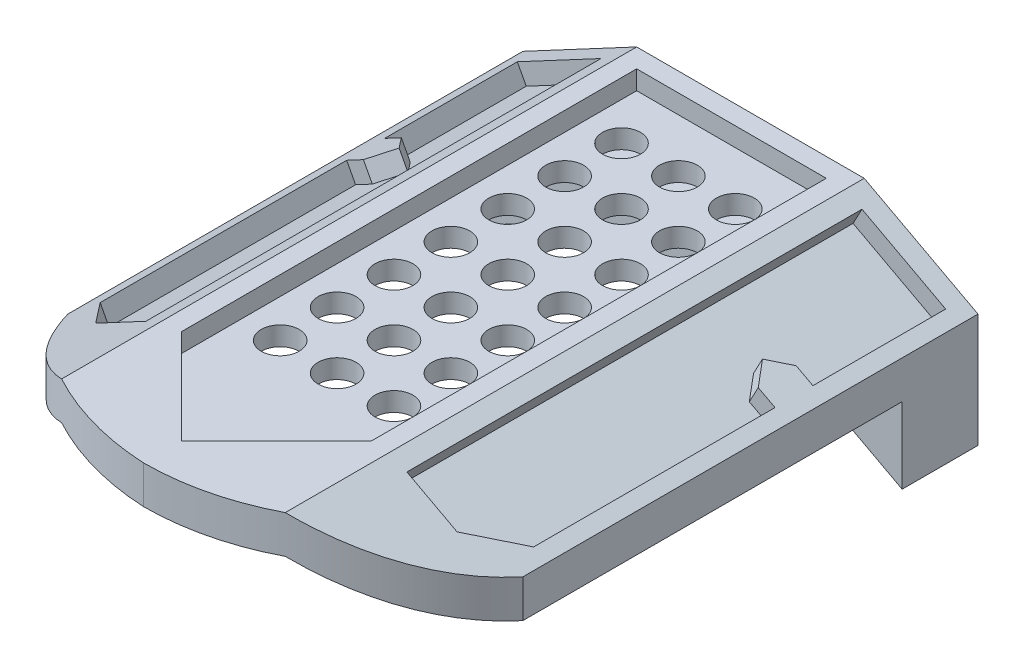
ISO-10303-21;
HEADER;
FILE_DESCRIPTION(('STEP AP214'),'2;1');
FILE_NAME('part.step','',(''),(''),'','','');
FILE_SCHEMA(('AUTOMOTIVE_DESIGN { 1 0 10303 214 1 1 1 1 }'));
ENDSEC;
DATA;
#1=APPLICATION_CONTEXT('core data for automotive mechanical design processes');
#2=APPLICATION_PROTOCOL_DEFINITION('international standard','automotive_design',2000,#1);
#3=PRODUCT_CONTEXT('',#1,'mechanical');
#4=PRODUCT('Part','Part','',(#3));
#5=PRODUCT_RELATED_PRODUCT_CATEGORY('part','',(#4));
#6=PRODUCT_DEFINITION_FORMATION('','',#4);
#7=PRODUCT_DEFINITION_CONTEXT('part definition',#1,'design');
#8=PRODUCT_DEFINITION('design','',#6,#7);
#9=PRODUCT_DEFINITION_SHAPE('','',#8);
#10=(LENGTH_UNIT() NAMED_UNIT(*) SI_UNIT(.MILLI.,.METRE.));
#11=(NAMED_UNIT(*) PLANE_ANGLE_UNIT() SI_UNIT($,.RADIAN.));
#12=(NAMED_UNIT(*) SI_UNIT($,.STERADIAN.) SOLID_ANGLE_UNIT());
#13=UNCERTAINTY_MEASURE_WITH_UNIT(LENGTH_MEASURE(1.E-05),#10,'distance_accuracy_value','');
#14=(GEOMETRIC_REPRESENTATION_CONTEXT(3) GLOBAL_UNCERTAINTY_ASSIGNED_CONTEXT((#13)) GLOBAL_UNIT_ASSIGNED_CONTEXT((#10,
#11,#12)) REPRESENTATION_CONTEXT('',''));
#15=CARTESIAN_POINT('',(0.,0.,0.));
#16=DIRECTION('',(0.,0.,1.));
#17=DIRECTION('',(1.,0.,0.));
#18=AXIS2_PLACEMENT_3D('',#15,#16,#17);
#19=CARTESIAN_POINT('',(38.1,20.32,203.2));
#20=DIRECTION('',(-0.470588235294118,0.88235294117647,0.));
#21=DIRECTION('',(-0.882352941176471,-0.470588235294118,0.));
#22=AXIS2_PLACEMENT_3D('',#19,#20,#21);
#23=PLANE('',#22);
#24=DIRECTION('',(0.,0.,-1.));
#25=VECTOR('',#24,1.);
#26=CARTESIAN_POINT('',(0.,0.,203.2));
#27=LINE('',#26,#25);
#28=CARTESIAN_POINT('',(0.,0.,152.4));
#29=VERTEX_POINT('',#28);
#30=CARTESIAN_POINT('',(0.,0.,25.4));
#31=VERTEX_POINT('',#30);
#32=EDGE_CURVE('E874',#29,#31,#27,.T.);
#33=ORIENTED_EDGE('',*,*,#32,.T.);
#34=DIRECTION('',(0.882352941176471,0.470588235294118,0.));
#35=VECTOR('',#34,1.);
#36=CARTESIAN_POINT('',(38.1,20.32,25.4));
#37=LINE('',#36,#35);
#38=CARTESIAN_POINT('',(38.1,20.32,25.4));
#39=VERTEX_POINT('',#38);
#40=EDGE_CURVE('E54',#31,#39,#37,.T.);
#41=ORIENTED_EDGE('',*,*,#40,.T.);
#42=DIRECTION('',(0.,0.,-1.));
#43=VECTOR('',#42,1.);
#44=CARTESIAN_POINT('',(38.1,20.32,203.2));
#45=LINE('',#44,#43);
#46=CARTESIAN_POINT('',(38.1,20.32,192.571633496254));
#47=VERTEX_POINT('',#46);
#48=EDGE_CURVE('E47',#47,#39,#45,.T.);
#49=ORIENTED_EDGE('',*,*,#48,.F.);
#50=CARTESIAN_POINT('',(80.4913587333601,42.9287246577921,114.21296189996));
#51=DIRECTION('',(-0.470588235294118,0.88235294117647,0.));
#52=DIRECTION('',(0.882352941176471,0.470588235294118,0.));
#53=AXIS2_PLACEMENT_3D('',#50,#51,#52);
#54=ELLIPSE('',#53,100.969179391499,89.0904524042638);
#55=EDGE_CURVE('E852',#47,#29,#54,.F.);
#56=ORIENTED_EDGE('',*,*,#55,.T.);
#57=EDGE_LOOP('',(#33,#41,#49,#56));
#58=FACE_BOUND('',#57,.T.);
#59=ADVANCED_FACE('F39',(#58),#23,.F.);
#60=CARTESIAN_POINT('',(114.3,20.32,203.2));
#61=DIRECTION('',(0.,1.,0.));
#62=DIRECTION('',(-1.,0.,0.));
#63=AXIS2_PLACEMENT_3D('',#60,#61,#62);
#64=PLANE('',#63);
#65=CARTESIAN_POINT('',(76.2000000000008,20.32,100.33));
#66=DIRECTION('',(0.,1.,0.));
#67=DIRECTION('',(0.,0.,1.));
#68=AXIS2_PLACEMENT_3D('',#65,#66,#67);
#69=CIRCLE('',#68,6.35000000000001);
#70=CARTESIAN_POINT('',(76.2000000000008,20.32,106.68));
#71=VERTEX_POINT('',#70);
#72=EDGE_CURVE('E439',#71,#71,#69,.T.);
#73=ORIENTED_EDGE('',*,*,#72,.T.);
#74=EDGE_LOOP('',(#73));
#75=FACE_BOUND('',#74,.T.);
#76=CARTESIAN_POINT('',(95.2500000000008,20.32,100.33));
#77=DIRECTION('',(0.,1.,0.));
#78=DIRECTION('',(0.,0.,1.));
#79=AXIS2_PLACEMENT_3D('',#76,#77,#78);
#80=CIRCLE('',#79,6.34999999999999);
#81=CARTESIAN_POINT('',(95.2500000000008,20.32,106.68));
#82=VERTEX_POINT('',#81);
#83=EDGE_CURVE('E448',#82,#82,#80,.T.);
#84=ORIENTED_EDGE('',*,*,#83,.T.);
#85=EDGE_LOOP('',(#84));
#86=FACE_BOUND('',#85,.T.);
#87=CARTESIAN_POINT('',(76.200000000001,20.32,119.38));
#88=DIRECTION('',(0.,1.,0.));
#89=DIRECTION('',(0.,0.,1.));
#90=AXIS2_PLACEMENT_3D('',#87,#88,#89);
#91=CIRCLE('',#90,6.34999999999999);
#92=CARTESIAN_POINT('',(76.200000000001,20.32,125.73));
#93=VERTEX_POINT('',#92);
#94=EDGE_CURVE('E456',#93,#93,#91,.T.);
#95=ORIENTED_EDGE('',*,*,#94,.T.);
#96=EDGE_LOOP('',(#95));
#97=FACE_BOUND('',#96,.T.);
#98=CARTESIAN_POINT('',(95.250000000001,20.32,119.38));
#99=DIRECTION('',(0.,1.,0.));
#100=DIRECTION('',(0.,0.,1.));
#101=AXIS2_PLACEMENT_3D('',#98,#99,#100);
#102=CIRCLE('',#101,6.34999999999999);
#103=CARTESIAN_POINT('',(95.250000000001,20.32,125.73));
#104=VERTEX_POINT('',#103);
#105=EDGE_CURVE('E464',#104,#104,#102,.T.);
#106=ORIENTED_EDGE('',*,*,#105,.T.);
#107=EDGE_LOOP('',(#106));
#108=FACE_BOUND('',#107,.T.);
#109=CARTESIAN_POINT('',(76.2000000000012,20.32,138.43));
#110=DIRECTION('',(0.,1.,0.));
#111=DIRECTION('',(0.,0.,1.));
#112=AXIS2_PLACEMENT_3D('',#109,#110,#111);
#113=CIRCLE('',#112,6.35000000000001);
#114=CARTESIAN_POINT('',(76.2000000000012,20.32,144.78));
#115=VERTEX_POINT('',#114);
#116=EDGE_CURVE('E407',#115,#115,#113,.T.);
#117=ORIENTED_EDGE('',*,*,#116,.T.);
#118=EDGE_LOOP('',(#117));
#119=FACE_BOUND('',#118,.T.);
#120=CARTESIAN_POINT('',(95.2500000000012,20.32,138.43));
#121=DIRECTION('',(0.,1.,0.));
#122=DIRECTION('',(0.,0.,1.));
#123=AXIS2_PLACEMENT_3D('',#120,#121,#122);
#124=CIRCLE('',#123,6.35000000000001);
#125=CARTESIAN_POINT('',(95.2500000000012,20.32,144.78));
#126=VERTEX_POINT('',#125);
#127=EDGE_CURVE('E416',#126,#126,#124,.T.);
#128=ORIENTED_EDGE('',*,*,#127,.T.);
#129=EDGE_LOOP('',(#128));
#130=FACE_BOUND('',#129,.T.);
#131=CARTESIAN_POINT('',(57.1500000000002,20.32,43.18));
#132=DIRECTION('',(0.,1.,0.));
#133=DIRECTION('',(0.,0.,1.));
#134=AXIS2_PLACEMENT_3D('',#131,#132,#133);
#135=CIRCLE('',#134,6.35);
#136=CARTESIAN_POINT('',(57.1500000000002,20.32,49.53));
#137=VERTEX_POINT('',#136);
#138=EDGE_CURVE('E424',#137,#137,#135,.T.);
#139=ORIENTED_EDGE('',*,*,#138,.T.);
#140=EDGE_LOOP('',(#139));
#141=FACE_BOUND('',#140,.T.);
#142=CARTESIAN_POINT('',(57.1500000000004,20.32,62.23));
#143=DIRECTION('',(0.,1.,0.));
#144=DIRECTION('',(0.,0.,1.));
#145=AXIS2_PLACEMENT_3D('',#142,#143,#144);
#146=CIRCLE('',#145,6.35);
#147=CARTESIAN_POINT('',(57.1500000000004,20.32,68.58));
#148=VERTEX_POINT('',#147);
#149=EDGE_CURVE('E432',#148,#148,#146,.T.);
#150=ORIENTED_EDGE('',*,*,#149,.T.);
#151=EDGE_LOOP('',(#150));
#152=FACE_BOUND('',#151,.T.);
#153=CARTESIAN_POINT('',(95.2500000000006,20.32,81.28));
#154=DIRECTION('',(0.,1.,0.));
#155=DIRECTION('',(0.,0.,1.));
#156=AXIS2_PLACEMENT_3D('',#153,#154,#155);
#157=CIRCLE('',#156,6.34999999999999);
#158=CARTESIAN_POINT('',(95.2500000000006,20.32,87.63));
#159=VERTEX_POINT('',#158);
#160=EDGE_CURVE('E530',#159,#159,#157,.T.);
#161=ORIENTED_EDGE('',*,*,#160,.T.);
#162=EDGE_LOOP('',(#161));
#163=FACE_BOUND('',#162,.T.);
#164=CARTESIAN_POINT('',(76.2000000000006,20.32,81.28));
#165=DIRECTION('',(0.,1.,0.));
#166=DIRECTION('',(0.,0.,1.));
#167=AXIS2_PLACEMENT_3D('',#164,#165,#166);
#168=CIRCLE('',#167,6.35000000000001);
#169=CARTESIAN_POINT('',(76.2000000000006,20.32,87.63));
#170=VERTEX_POINT('',#169);
#171=EDGE_CURVE('E522',#170,#170,#168,.T.);
#172=ORIENTED_EDGE('',*,*,#171,.T.);
#173=EDGE_LOOP('',(#172));
#174=FACE_BOUND('',#173,.T.);
#175=CARTESIAN_POINT('',(95.2500000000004,20.32,62.23));
#176=DIRECTION('',(0.,1.,0.));
#177=DIRECTION('',(0.,0.,1.));
#178=AXIS2_PLACEMENT_3D('',#175,#176,#177);
#179=CIRCLE('',#178,6.35000000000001);
#180=CARTESIAN_POINT('',(95.2500000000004,20.32,68.58));
#181=VERTEX_POINT('',#180);
#182=EDGE_CURVE('E514',#181,#181,#179,.T.);
#183=ORIENTED_EDGE('',*,*,#182,.T.);
#184=EDGE_LOOP('',(#183));
#185=FACE_BOUND('',#184,.T.);
#186=CARTESIAN_POINT('',(76.2000000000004,20.32,62.23));
#187=DIRECTION('',(0.,1.,0.));
#188=DIRECTION('',(0.,0.,1.));
#189=AXIS2_PLACEMENT_3D('',#186,#187,#188);
#190=CIRCLE('',#189,6.35);
#191=CARTESIAN_POINT('',(76.2000000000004,20.32,68.58));
#192=VERTEX_POINT('',#191);
#193=EDGE_CURVE('E506',#192,#192,#190,.T.);
#194=ORIENTED_EDGE('',*,*,#193,.T.);
#195=EDGE_LOOP('',(#194));
#196=FACE_BOUND('',#195,.T.);
#197=CARTESIAN_POINT('',(95.2500000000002,20.32,43.18));
#198=DIRECTION('',(0.,1.,0.));
#199=DIRECTION('',(0.,0.,1.));
#200=AXIS2_PLACEMENT_3D('',#197,#198,#199);
#201=CIRCLE('',#200,6.35000000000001);
#202=CARTESIAN_POINT('',(95.2500000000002,20.32,49.53));
#203=VERTEX_POINT('',#202);
#204=EDGE_CURVE('E498',#203,#203,#201,.T.);
#205=ORIENTED_EDGE('',*,*,#204,.T.);
#206=EDGE_LOOP('',(#205));
#207=FACE_BOUND('',#206,.T.);
#208=CARTESIAN_POINT('',(76.2000000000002,20.32,43.18));
#209=DIRECTION('',(0.,1.,0.));
#210=DIRECTION('',(0.,0.,1.));
#211=AXIS2_PLACEMENT_3D('',#208,#209,#210);
#212=CIRCLE('',#211,6.35);
#213=CARTESIAN_POINT('',(76.2000000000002,20.32,49.53));
#214=VERTEX_POINT('',#213);
#215=EDGE_CURVE('E490',#214,#214,#212,.T.);
#216=ORIENTED_EDGE('',*,*,#215,.T.);
#217=EDGE_LOOP('',(#216));
#218=FACE_BOUND('',#217,.T.);
#219=CARTESIAN_POINT('',(57.1500000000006,20.32,81.28));
#220=DIRECTION('',(0.,1.,0.));
#221=DIRECTION('',(0.,0.,1.));
#222=AXIS2_PLACEMENT_3D('',#219,#220,#221);
#223=CIRCLE('',#222,6.34999999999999);
#224=CARTESIAN_POINT('',(57.1500000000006,20.32,87.63));
#225=VERTEX_POINT('',#224);
#226=EDGE_CURVE('E375',#225,#225,#223,.T.);
#227=ORIENTED_EDGE('',*,*,#226,.T.);
#228=EDGE_LOOP('',(#227));
#229=FACE_BOUND('',#228,.T.);
#230=CARTESIAN_POINT('',(57.1500000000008,20.32,100.33));
#231=DIRECTION('',(0.,1.,0.));
#232=DIRECTION('',(0.,0.,1.));
#233=AXIS2_PLACEMENT_3D('',#230,#231,#232);
#234=CIRCLE('',#233,6.35000000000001);
#235=CARTESIAN_POINT('',(57.1500000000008,20.32,106.68));
#236=VERTEX_POINT('',#235);
#237=EDGE_CURVE('E384',#236,#236,#234,.T.);
#238=ORIENTED_EDGE('',*,*,#237,.T.);
#239=EDGE_LOOP('',(#238));
#240=FACE_BOUND('',#239,.T.);
#241=CARTESIAN_POINT('',(57.150000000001,20.32,119.38));
#242=DIRECTION('',(0.,1.,0.));
#243=DIRECTION('',(0.,0.,1.));
#244=AXIS2_PLACEMENT_3D('',#241,#242,#243);
#245=CIRCLE('',#244,6.35);
#246=CARTESIAN_POINT('',(57.150000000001,20.32,125.73));
#247=VERTEX_POINT('',#246);
#248=EDGE_CURVE('E392',#247,#247,#245,.T.);
#249=ORIENTED_EDGE('',*,*,#248,.T.);
#250=EDGE_LOOP('',(#249));
#251=FACE_BOUND('',#250,.T.);
#252=CARTESIAN_POINT('',(57.1500000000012,20.32,138.43));
#253=DIRECTION('',(0.,1.,0.));
#254=DIRECTION('',(0.,0.,1.));
#255=AXIS2_PLACEMENT_3D('',#252,#253,#254);
#256=CIRCLE('',#255,6.34999999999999);
#257=CARTESIAN_POINT('',(57.1500000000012,20.32,144.78));
#258=VERTEX_POINT('',#257);
#259=EDGE_CURVE('E400',#258,#258,#256,.T.);
#260=ORIENTED_EDGE('',*,*,#259,.T.);
#261=EDGE_LOOP('',(#260));
#262=FACE_BOUND('',#261,.T.);
#263=ORIENTED_EDGE('',*,*,#48,.T.);
#264=DIRECTION('',(1.,0.,0.));
#265=VECTOR('',#264,1.);
#266=CARTESIAN_POINT('',(114.3,20.32,25.4));
#267=LINE('',#266,#265);
#268=CARTESIAN_POINT('',(50.9282960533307,20.32,25.4));
#269=VERTEX_POINT('',#268);
#270=EDGE_CURVE('E354',#39,#269,#267,.T.);
#271=ORIENTED_EDGE('',*,*,#270,.T.);
#272=CARTESIAN_POINT('',(57.15,20.32,24.13));
#273=DIRECTION('',(0.,1.,0.));
#274=DIRECTION('',(0.,0.,1.));
#275=AXIS2_PLACEMENT_3D('',#272,#273,#274);
#276=CIRCLE('',#275,6.35000000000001);
#277=CARTESIAN_POINT('',(63.3717039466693,20.32,25.4));
#278=VERTEX_POINT('',#277);
#279=EDGE_CURVE('E542',#269,#278,#276,.T.);
#280=ORIENTED_EDGE('',*,*,#279,.T.);
#281=CARTESIAN_POINT('',(69.9782960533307,20.32,25.4));
#282=VERTEX_POINT('',#281);
#283=EDGE_CURVE('E903',#278,#282,#267,.T.);
#284=ORIENTED_EDGE('',*,*,#283,.T.);
#285=CARTESIAN_POINT('',(76.2,20.32,24.13));
#286=DIRECTION('',(0.,1.,0.));
#287=DIRECTION('',(0.,0.,1.));
#288=AXIS2_PLACEMENT_3D('',#285,#286,#287);
#289=CIRCLE('',#288,6.35000000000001);
#290=CARTESIAN_POINT('',(82.4217039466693,20.32,25.4));
#291=VERTEX_POINT('',#290);
#292=EDGE_CURVE('E476',#282,#291,#289,.T.);
#293=ORIENTED_EDGE('',*,*,#292,.T.);
#294=CARTESIAN_POINT('',(89.0282960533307,20.32,25.4));
#295=VERTEX_POINT('',#294);
#296=EDGE_CURVE('E911',#291,#295,#267,.T.);
#297=ORIENTED_EDGE('',*,*,#296,.T.);
#298=CARTESIAN_POINT('',(95.25,20.32,24.13));
#299=DIRECTION('',(0.,1.,0.));
#300=DIRECTION('',(0.,0.,1.));
#301=AXIS2_PLACEMENT_3D('',#298,#299,#300);
#302=CIRCLE('',#301,6.35000000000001);
#303=CARTESIAN_POINT('',(101.471703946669,20.32,25.4));
#304=VERTEX_POINT('',#303);
#305=EDGE_CURVE('E485',#295,#304,#302,.T.);
#306=ORIENTED_EDGE('',*,*,#305,.T.);
#307=CARTESIAN_POINT('',(114.3,20.32,25.4));
#308=VERTEX_POINT('',#307);
#309=EDGE_CURVE('E62',#304,#308,#267,.T.);
#310=ORIENTED_EDGE('',*,*,#309,.T.);
#311=DIRECTION('',(0.,0.,-1.));
#312=VECTOR('',#311,1.);
#313=CARTESIAN_POINT('',(114.3,20.32,203.2));
#314=LINE('',#313,#312);
#315=CARTESIAN_POINT('',(114.3,20.32,193.88177247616));
#316=VERTEX_POINT('',#315);
#317=EDGE_CURVE('E891',#316,#308,#314,.T.);
#318=ORIENTED_EDGE('',*,*,#317,.F.);
#319=CARTESIAN_POINT('',(76.2,20.32,120.65));
#320=DIRECTION('',(0.,1.,0.));
#321=DIRECTION('',(-1.,0.,0.));
#322=AXIS2_PLACEMENT_3D('',#319,#320,#321);
#323=CIRCLE('',#322,82.55);
#324=CARTESIAN_POINT('',(76.2,20.32,203.2));
#325=VERTEX_POINT('',#324);
#326=EDGE_CURVE('E833',#316,#325,#323,.F.);
#327=ORIENTED_EDGE('',*,*,#326,.T.);
#328=CARTESIAN_POINT('',(80.4913587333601,20.32,114.21296189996));
#329=DIRECTION('',(0.,1.,0.));
#330=DIRECTION('',(-1.,0.,0.));
#331=AXIS2_PLACEMENT_3D('',#328,#329,#330);
#332=CIRCLE('',#331,89.0904524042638);
#333=EDGE_CURVE('E848',#325,#47,#332,.F.);
#334=ORIENTED_EDGE('',*,*,#333,.T.);
#335=EDGE_LOOP('',(#263,#271,#280,#284,#293,#297,#306,#310,#318,#327,#334));
#336=FACE_BOUND('',#335,.T.);
#337=ADVANCED_FACE('F895',(#75,#86,#97,#108,#119,#130,#141,#152,#163,#174,#185,#196,#207,#218,
#229,#240,#251,#262,#336),#64,.F.);
#338=CARTESIAN_POINT('',(152.4,0.,203.2));
#339=DIRECTION('',(0.470588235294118,0.88235294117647,0.));
#340=DIRECTION('',(-0.882352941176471,0.470588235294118,0.));
#341=AXIS2_PLACEMENT_3D('',#338,#339,#340);
#342=PLANE('',#341);
#343=ORIENTED_EDGE('',*,*,#317,.T.);
#344=DIRECTION('',(0.88235294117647,-0.470588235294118,0.));
#345=VECTOR('',#344,1.);
#346=CARTESIAN_POINT('',(152.4,0.,25.4));
#347=LINE('',#346,#345);
#348=CARTESIAN_POINT('',(152.4,0.,25.4));
#349=VERTEX_POINT('',#348);
#350=EDGE_CURVE('E315',#308,#349,#347,.T.);
#351=ORIENTED_EDGE('',*,*,#350,.T.);
#352=DIRECTION('',(0.,0.,-1.));
#353=VECTOR('',#352,1.);
#354=CARTESIAN_POINT('',(152.4,0.,203.2));
#355=LINE('',#354,#353);
#356=CARTESIAN_POINT('',(152.4,0.,152.4));
#357=VERTEX_POINT('',#356);
#358=EDGE_CURVE('E333',#357,#349,#355,.T.);
#359=ORIENTED_EDGE('',*,*,#358,.F.);
#360=CARTESIAN_POINT('',(76.2,40.64,120.65));
#361=DIRECTION('',(0.470588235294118,0.88235294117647,0.));
#362=DIRECTION('',(-0.882352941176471,0.470588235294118,0.));
#363=AXIS2_PLACEMENT_3D('',#360,#361,#362);
#364=ELLIPSE('',#363,93.5566666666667,82.55);
#365=EDGE_CURVE('E829',#357,#316,#364,.F.);
#366=ORIENTED_EDGE('',*,*,#365,.T.);
#367=EDGE_LOOP('',(#343,#351,#359,#366));
#368=FACE_BOUND('',#367,.T.);
#369=ADVANCED_FACE('F925',(#368),#342,.F.);
#370=CARTESIAN_POINT('',(152.4,0.,203.2));
#371=DIRECTION('',(-1.,0.,0.));
#372=DIRECTION('',(0.,0.,1.));
#373=AXIS2_PLACEMENT_3D('',#370,#371,#372);
#374=PLANE('',#373);
#375=DIRECTION('',(0.,0.,-1.));
#376=VECTOR('',#375,1.);
#377=CARTESIAN_POINT('',(152.4,12.7,203.2));
#378=LINE('',#377,#376);
#379=CARTESIAN_POINT('',(152.4,12.7,152.4));
#380=VERTEX_POINT('',#379);
#381=CARTESIAN_POINT('',(152.4,12.7,0.));
#382=VERTEX_POINT('',#381);
#383=EDGE_CURVE('E886',#380,#382,#378,.T.);
#384=ORIENTED_EDGE('',*,*,#383,.F.);
#385=DIRECTION('',(0.,1.,0.));
#386=VECTOR('',#385,1.);
#387=CARTESIAN_POINT('',(152.4,-27.94,152.4));
#388=LINE('',#387,#386);
#389=EDGE_CURVE('E822',#357,#380,#388,.T.);
#390=ORIENTED_EDGE('',*,*,#389,.F.);
#391=ORIENTED_EDGE('',*,*,#358,.T.);
#392=DIRECTION('',(0.,-1.,0.));
#393=VECTOR('',#392,1.);
#394=CARTESIAN_POINT('',(152.4,-25.4,25.4));
#395=LINE('',#394,#393);
#396=CARTESIAN_POINT('',(152.4,-25.4,25.4));
#397=VERTEX_POINT('',#396);
#398=EDGE_CURVE('E322',#349,#397,#395,.T.);
#399=ORIENTED_EDGE('',*,*,#398,.T.);
#400=DIRECTION('',(0.,0.,-1.));
#401=VECTOR('',#400,1.);
#402=CARTESIAN_POINT('',(152.4,-25.4,25.4));
#403=LINE('',#402,#401);
#404=CARTESIAN_POINT('',(152.4,-25.4,0.));
#405=VERTEX_POINT('',#404);
#406=EDGE_CURVE('E304',#397,#405,#403,.T.);
#407=ORIENTED_EDGE('',*,*,#406,.T.);
#408=DIRECTION('',(0.,1.,0.));
#409=VECTOR('',#408,1.);
#410=CARTESIAN_POINT('',(152.4,0.,0.));
#411=LINE('',#410,#409);
#412=EDGE_CURVE('E856',#405,#382,#411,.T.);
#413=ORIENTED_EDGE('',*,*,#412,.T.);
#414=EDGE_LOOP('',(#384,#390,#391,#399,#407,#413));
#415=FACE_BOUND('',#414,.T.);
#416=ADVANCED_FACE('F330',(#415),#374,.F.);
#417=CARTESIAN_POINT('',(114.3,33.02,203.2));
#418=DIRECTION('',(-0.470588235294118,-0.882352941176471,0.));
#419=DIRECTION('',(0.882352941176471,-0.470588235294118,0.));
#420=AXIS2_PLACEMENT_3D('',#417,#418,#419);
#421=PLANE('',#420);
#422=DIRECTION('',(0.,0.,1.));
#423=VECTOR('',#422,1.);
#424=CARTESIAN_POINT('',(119.902941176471,30.0317647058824,6.35));
#425=LINE('',#424,#423);
#426=CARTESIAN_POINT('',(119.902941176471,30.0317647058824,6.34999999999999));
#427=VERTEX_POINT('',#426);
#428=CARTESIAN_POINT('',(119.902941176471,30.0317647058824,158.75));
#429=VERTEX_POINT('',#428);
#430=EDGE_CURVE('E644',#427,#429,#425,.T.);
#431=ORIENTED_EDGE('',*,*,#430,.F.);
#432=DIRECTION('',(-0.88235294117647,0.470588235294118,0.));
#433=VECTOR('',#432,1.);
#434=CARTESIAN_POINT('',(147.917647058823,15.0905882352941,6.35));
#435=LINE('',#434,#433);
#436=CARTESIAN_POINT('',(147.917647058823,15.0905882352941,6.35));
#437=VERTEX_POINT('',#436);
#438=EDGE_CURVE('E590',#437,#427,#435,.T.);
#439=ORIENTED_EDGE('',*,*,#438,.F.);
#440=DIRECTION('',(0.,0.,-1.));
#441=VECTOR('',#440,1.);
#442=CARTESIAN_POINT('',(147.917647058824,15.0905882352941,50.8));
#443=LINE('',#442,#441);
#444=CARTESIAN_POINT('',(147.917647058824,15.0905882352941,50.8));
#445=VERTEX_POINT('',#444);
#446=EDGE_CURVE('E605',#445,#437,#443,.T.);
#447=ORIENTED_EDGE('',*,*,#446,.F.);
#448=DIRECTION('',(0.88235294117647,-0.470588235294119,0.));
#449=VECTOR('',#448,1.);
#450=CARTESIAN_POINT('',(142.314705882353,18.0788235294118,50.8));
#451=LINE('',#450,#449);
#452=CARTESIAN_POINT('',(142.314705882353,18.0788235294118,50.8));
#453=VERTEX_POINT('',#452);
#454=EDGE_CURVE('E672',#453,#445,#451,.T.);
#455=ORIENTED_EDGE('',*,*,#454,.F.);
#456=DIRECTION('',(0.583274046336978,-0.311079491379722,-0.750347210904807));
#457=VECTOR('',#456,1.);
#458=CARTESIAN_POINT('',(137.378604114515,20.7114111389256,57.15));
#459=LINE('',#458,#457);
#460=CARTESIAN_POINT('',(137.378604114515,20.7114111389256,57.15));
#461=VERTEX_POINT('',#460);
#462=EDGE_CURVE('E668',#461,#453,#459,.T.);
#463=ORIENTED_EDGE('',*,*,#462,.F.);
#464=DIRECTION('',(-0.583274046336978,0.311079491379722,-0.750347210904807));
#465=VECTOR('',#464,1.);
#466=CARTESIAN_POINT('',(142.314705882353,18.0788235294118,63.5));
#467=LINE('',#466,#465);
#468=CARTESIAN_POINT('',(142.314705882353,18.0788235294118,63.5));
#469=VERTEX_POINT('',#468);
#470=EDGE_CURVE('E664',#469,#461,#467,.T.);
#471=ORIENTED_EDGE('',*,*,#470,.F.);
#472=DIRECTION('',(-0.88235294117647,0.470588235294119,0.));
#473=VECTOR('',#472,1.);
#474=CARTESIAN_POINT('',(147.917647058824,15.0905882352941,63.5));
#475=LINE('',#474,#473);
#476=CARTESIAN_POINT('',(147.917647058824,15.0905882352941,63.5));
#477=VERTEX_POINT('',#476);
#478=EDGE_CURVE('E660',#477,#469,#475,.T.);
#479=ORIENTED_EDGE('',*,*,#478,.F.);
#480=DIRECTION('',(0.,0.,-1.));
#481=VECTOR('',#480,1.);
#482=CARTESIAN_POINT('',(147.917647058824,15.0905882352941,144.334301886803));
#483=LINE('',#482,#481);
#484=CARTESIAN_POINT('',(147.917647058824,15.0905882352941,144.334301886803));
#485=VERTEX_POINT('',#484);
#486=EDGE_CURVE('E656',#485,#477,#483,.T.);
#487=ORIENTED_EDGE('',*,*,#486,.F.);
#488=DIRECTION('',(0.583274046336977,-0.311079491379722,-0.750347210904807));
#489=VECTOR('',#488,1.);
#490=CARTESIAN_POINT('',(136.711764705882,21.0670588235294,158.75));
#491=LINE('',#490,#489);
#492=CARTESIAN_POINT('',(136.711764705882,21.0670588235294,158.75));
#493=VERTEX_POINT('',#492);
#494=EDGE_CURVE('E652',#493,#485,#491,.T.);
#495=ORIENTED_EDGE('',*,*,#494,.F.);
#496=DIRECTION('',(0.882352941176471,-0.470588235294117,0.));
#497=VECTOR('',#496,1.);
#498=CARTESIAN_POINT('',(119.902941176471,30.0317647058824,158.75));
#499=LINE('',#498,#497);
#500=EDGE_CURVE('E648',#429,#493,#499,.T.);
#501=ORIENTED_EDGE('',*,*,#500,.F.);
#502=EDGE_LOOP('',(#431,#439,#447,#455,#463,#471,#479,#487,#495,#501));
#503=FACE_BOUND('',#502,.T.);
#504=DIRECTION('',(0.,0.,-1.));
#505=VECTOR('',#504,1.);
#506=CARTESIAN_POINT('',(114.3,33.02,203.2));
#507=LINE('',#506,#505);
#508=CARTESIAN_POINT('',(114.3,33.02,193.88177247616));
#509=VERTEX_POINT('',#508);
#510=CARTESIAN_POINT('',(114.3,33.02,0.));
#511=VERTEX_POINT('',#510);
#512=EDGE_CURVE('E883',#509,#511,#507,.T.);
#513=ORIENTED_EDGE('',*,*,#512,.F.);
#514=CARTESIAN_POINT('',(76.2,53.34,120.65));
#515=DIRECTION('',(-0.470588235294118,-0.882352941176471,0.));
#516=DIRECTION('',(-0.882352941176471,0.470588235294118,0.));
#517=AXIS2_PLACEMENT_3D('',#514,#515,#516);
#518=ELLIPSE('',#517,93.5566666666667,82.55);
#519=EDGE_CURVE('E825',#509,#380,#518,.F.);
#520=ORIENTED_EDGE('',*,*,#519,.T.);
#521=ORIENTED_EDGE('',*,*,#383,.T.);
#522=DIRECTION('',(-0.882352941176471,0.470588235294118,0.));
#523=VECTOR('',#522,1.);
#524=CARTESIAN_POINT('',(114.3,33.02,0.));
#525=LINE('',#524,#523);
#526=EDGE_CURVE('E859',#382,#511,#525,.T.);
#527=ORIENTED_EDGE('',*,*,#526,.T.);
#528=EDGE_LOOP('',(#513,#520,#521,#527));
#529=FACE_BOUND('',#528,.T.);
#530=ADVANCED_FACE('F947',(#503,#529),#421,.F.);
#531=CARTESIAN_POINT('',(38.1,33.02,203.2));
#532=DIRECTION('',(0.,-1.,0.));
#533=DIRECTION('',(1.,0.,0.));
#534=AXIS2_PLACEMENT_3D('',#531,#532,#533);
#535=PLANE('',#534);
#536=DIRECTION('',(0.707106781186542,0.,-0.707106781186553));
#537=VECTOR('',#536,1.);
#538=CARTESIAN_POINT('',(107.95,33.02,158.75));
#539=LINE('',#538,#537);
#540=CARTESIAN_POINT('',(76.2,33.02,190.500000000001));
#541=VERTEX_POINT('',#540);
#542=CARTESIAN_POINT('',(107.95,33.02,158.75));
#543=VERTEX_POINT('',#542);
#544=EDGE_CURVE('E551',#541,#543,#539,.T.);
#545=ORIENTED_EDGE('',*,*,#544,.F.);
#546=DIRECTION('',(0.707106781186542,0.,0.707106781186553));
#547=VECTOR('',#546,1.);
#548=CARTESIAN_POINT('',(76.2,33.02,190.500000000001));
#549=LINE('',#548,#547);
#550=CARTESIAN_POINT('',(44.45,33.02,158.75));
#551=VERTEX_POINT('',#550);
#552=EDGE_CURVE('E541',#551,#541,#549,.T.);
#553=ORIENTED_EDGE('',*,*,#552,.F.);
#554=DIRECTION('',(0.,0.,1.));
#555=VECTOR('',#554,1.);
#556=CARTESIAN_POINT('',(44.45,33.02,6.35));
#557=LINE('',#556,#555);
#558=CARTESIAN_POINT('',(44.45,33.02,6.35));
#559=VERTEX_POINT('',#558);
#560=EDGE_CURVE('E562',#559,#551,#557,.T.);
#561=ORIENTED_EDGE('',*,*,#560,.F.);
#562=DIRECTION('',(-1.,0.,0.));
#563=VECTOR('',#562,1.);
#564=CARTESIAN_POINT('',(44.45,33.02,6.35));
#565=LINE('',#564,#563);
#566=CARTESIAN_POINT('',(107.95,33.02,6.35));
#567=VERTEX_POINT('',#566);
#568=EDGE_CURVE('E568',#567,#559,#565,.T.);
#569=ORIENTED_EDGE('',*,*,#568,.F.);
#570=DIRECTION('',(0.,0.,-1.));
#571=VECTOR('',#570,1.);
#572=CARTESIAN_POINT('',(107.95,33.02,6.35));
#573=LINE('',#572,#571);
#574=EDGE_CURVE('E580',#543,#567,#573,.T.);
#575=ORIENTED_EDGE('',*,*,#574,.F.);
#576=EDGE_LOOP('',(#545,#553,#561,#569,#575));
#577=FACE_BOUND('',#576,.T.);
#578=CARTESIAN_POINT('',(80.4913587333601,33.02,114.21296189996));
#579=DIRECTION('',(0.,-1.,0.));
#580=DIRECTION('',(0.,0.,-1.));
#581=AXIS2_PLACEMENT_3D('',#578,#579,#580);
#582=CIRCLE('',#581,89.0904524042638);
#583=CARTESIAN_POINT('',(76.2,33.02,203.2));
#584=VERTEX_POINT('',#583);
#585=CARTESIAN_POINT('',(38.1,33.02,192.571633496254));
#586=VERTEX_POINT('',#585);
#587=EDGE_CURVE('E837',#584,#586,#582,.T.);
#588=ORIENTED_EDGE('',*,*,#587,.F.);
#589=CARTESIAN_POINT('',(76.2,33.02,120.65));
#590=DIRECTION('',(0.,-1.,0.));
#591=DIRECTION('',(0.,0.,1.));
#592=AXIS2_PLACEMENT_3D('',#589,#590,#591);
#593=CIRCLE('',#592,82.55);
#594=EDGE_CURVE('E792',#509,#584,#593,.T.);
#595=ORIENTED_EDGE('',*,*,#594,.F.);
#596=ORIENTED_EDGE('',*,*,#512,.T.);
#597=DIRECTION('',(-1.,0.,0.));
#598=VECTOR('',#597,1.);
#599=CARTESIAN_POINT('',(38.1,33.02,0.));
#600=LINE('',#599,#598);
#601=CARTESIAN_POINT('',(38.1,33.02,0.));
#602=VERTEX_POINT('',#601);
#603=EDGE_CURVE('E863',#511,#602,#600,.T.);
#604=ORIENTED_EDGE('',*,*,#603,.T.);
#605=DIRECTION('',(0.,0.,-1.));
#606=VECTOR('',#605,1.);
#607=CARTESIAN_POINT('',(38.1,33.02,203.2));
#608=LINE('',#607,#606);
#609=EDGE_CURVE('E880',#586,#602,#608,.T.);
#610=ORIENTED_EDGE('',*,*,#609,.F.);
#611=EDGE_LOOP('',(#588,#595,#596,#604,#610));
#612=FACE_BOUND('',#611,.T.);
#613=ADVANCED_FACE('F951',(#577,#612),#535,.F.);
#614=CARTESIAN_POINT('',(0.,12.7,203.2));
#615=DIRECTION('',(0.470588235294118,-0.88235294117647,0.));
#616=DIRECTION('',(0.882352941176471,0.470588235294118,0.));
#617=AXIS2_PLACEMENT_3D('',#614,#615,#616);
#618=PLANE('',#617);
#619=DIRECTION('',(0.,0.,1.));
#620=VECTOR('',#619,1.);
#621=CARTESIAN_POINT('',(4.4823529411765,15.0905882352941,6.35));
#622=LINE('',#621,#620);
#623=CARTESIAN_POINT('',(4.4823529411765,15.0905882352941,6.34999999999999));
#624=VERTEX_POINT('',#623);
#625=CARTESIAN_POINT('',(4.4823529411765,15.0905882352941,50.8));
#626=VERTEX_POINT('',#625);
#627=EDGE_CURVE('E754',#624,#626,#622,.T.);
#628=ORIENTED_EDGE('',*,*,#627,.F.);
#629=DIRECTION('',(-0.882352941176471,-0.470588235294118,0.));
#630=VECTOR('',#629,1.);
#631=CARTESIAN_POINT('',(32.4970588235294,30.0317647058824,6.35));
#632=LINE('',#631,#630);
#633=CARTESIAN_POINT('',(32.4970588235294,30.0317647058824,6.35));
#634=VERTEX_POINT('',#633);
#635=EDGE_CURVE('E682',#634,#624,#632,.T.);
#636=ORIENTED_EDGE('',*,*,#635,.F.);
#637=DIRECTION('',(0.,0.,-1.));
#638=VECTOR('',#637,1.);
#639=CARTESIAN_POINT('',(32.4970588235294,30.0317647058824,158.75));
#640=LINE('',#639,#638);
#641=CARTESIAN_POINT('',(32.4970588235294,30.0317647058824,158.75));
#642=VERTEX_POINT('',#641);
#643=EDGE_CURVE('E715',#642,#634,#640,.T.);
#644=ORIENTED_EDGE('',*,*,#643,.F.);
#645=DIRECTION('',(0.88235294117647,0.470588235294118,0.));
#646=VECTOR('',#645,1.);
#647=CARTESIAN_POINT('',(15.6882352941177,21.0670588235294,158.75));
#648=LINE('',#647,#646);
#649=CARTESIAN_POINT('',(15.6882352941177,21.0670588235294,158.75));
#650=VERTEX_POINT('',#649);
#651=EDGE_CURVE('E782',#650,#642,#648,.T.);
#652=ORIENTED_EDGE('',*,*,#651,.F.);
#653=DIRECTION('',(0.623917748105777,0.332756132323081,0.707106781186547));
#654=VECTOR('',#653,1.);
#655=CARTESIAN_POINT('',(4.48235294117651,15.0905882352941,146.05));
#656=LINE('',#655,#654);
#657=CARTESIAN_POINT('',(4.48235294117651,15.0905882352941,146.05));
#658=VERTEX_POINT('',#657);
#659=EDGE_CURVE('E778',#658,#650,#656,.T.);
#660=ORIENTED_EDGE('',*,*,#659,.F.);
#661=DIRECTION('',(0.,0.,1.));
#662=VECTOR('',#661,1.);
#663=CARTESIAN_POINT('',(4.4823529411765,15.0905882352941,63.5));
#664=LINE('',#663,#662);
#665=CARTESIAN_POINT('',(4.4823529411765,15.0905882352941,63.5));
#666=VERTEX_POINT('',#665);
#667=EDGE_CURVE('E774',#666,#658,#664,.T.);
#668=ORIENTED_EDGE('',*,*,#667,.F.);
#669=DIRECTION('',(-0.88235294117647,-0.470588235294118,0.));
#670=VECTOR('',#669,1.);
#671=CARTESIAN_POINT('',(10.0852941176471,18.0788235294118,63.5));
#672=LINE('',#671,#670);
#673=CARTESIAN_POINT('',(10.0852941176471,18.0788235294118,63.5));
#674=VERTEX_POINT('',#673);
#675=EDGE_CURVE('E770',#674,#666,#672,.T.);
#676=ORIENTED_EDGE('',*,*,#675,.F.);
#677=DIRECTION('',(-0.623917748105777,-0.332756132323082,0.707106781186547));
#678=VECTOR('',#677,1.);
#679=CARTESIAN_POINT('',(15.6882352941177,21.0670588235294,57.15));
#680=LINE('',#679,#678);
#681=CARTESIAN_POINT('',(15.6882352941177,21.0670588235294,57.15));
#682=VERTEX_POINT('',#681);
#683=EDGE_CURVE('E766',#682,#674,#680,.T.);
#684=ORIENTED_EDGE('',*,*,#683,.F.);
#685=DIRECTION('',(0.623917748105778,0.332756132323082,0.707106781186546));
#686=VECTOR('',#685,1.);
#687=CARTESIAN_POINT('',(10.0852941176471,18.0788235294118,50.8));
#688=LINE('',#687,#686);
#689=CARTESIAN_POINT('',(10.0852941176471,18.0788235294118,50.8));
#690=VERTEX_POINT('',#689);
#691=EDGE_CURVE('E762',#690,#682,#688,.T.);
#692=ORIENTED_EDGE('',*,*,#691,.F.);
#693=DIRECTION('',(0.882352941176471,0.470588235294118,0.));
#694=VECTOR('',#693,1.);
#695=CARTESIAN_POINT('',(4.4823529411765,15.0905882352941,50.8));
#696=LINE('',#695,#694);
#697=EDGE_CURVE('E758',#626,#690,#696,.T.);
#698=ORIENTED_EDGE('',*,*,#697,.F.);
#699=EDGE_LOOP('',(#628,#636,#644,#652,#660,#668,#676,#684,#692,#698));
#700=FACE_BOUND('',#699,.T.);
#701=DIRECTION('',(0.,0.,-1.));
#702=VECTOR('',#701,1.);
#703=CARTESIAN_POINT('',(0.,12.7,203.2));
#704=LINE('',#703,#702);
#705=CARTESIAN_POINT('',(0.,12.7,152.4));
#706=VERTEX_POINT('',#705);
#707=CARTESIAN_POINT('',(0.,12.7,0.));
#708=VERTEX_POINT('',#707);
#709=EDGE_CURVE('E877',#706,#708,#704,.T.);
#710=ORIENTED_EDGE('',*,*,#709,.F.);
#711=CARTESIAN_POINT('',(80.4913587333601,55.6287246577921,114.21296189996));
#712=DIRECTION('',(0.470588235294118,-0.88235294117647,0.));
#713=DIRECTION('',(0.882352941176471,0.470588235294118,0.));
#714=AXIS2_PLACEMENT_3D('',#711,#712,#713);
#715=ELLIPSE('',#714,100.969179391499,89.0904524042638);
#716=EDGE_CURVE('E844',#706,#586,#715,.F.);
#717=ORIENTED_EDGE('',*,*,#716,.T.);
#718=ORIENTED_EDGE('',*,*,#609,.T.);
#719=DIRECTION('',(-0.882352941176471,-0.470588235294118,0.));
#720=VECTOR('',#719,1.);
#721=CARTESIAN_POINT('',(0.,12.7,0.));
#722=LINE('',#721,#720);
#723=EDGE_CURVE('E867',#602,#708,#722,.T.);
#724=ORIENTED_EDGE('',*,*,#723,.T.);
#725=EDGE_LOOP('',(#710,#717,#718,#724));
#726=FACE_BOUND('',#725,.T.);
#727=ADVANCED_FACE('F954',(#700,#726),#618,.F.);
#728=CARTESIAN_POINT('',(0.,0.,203.2));
#729=DIRECTION('',(1.,0.,0.));
#730=DIRECTION('',(0.,0.,-1.));
#731=AXIS2_PLACEMENT_3D('',#728,#729,#730);
#732=PLANE('',#731);
#733=ORIENTED_EDGE('',*,*,#32,.F.);
#734=DIRECTION('',(0.,1.,0.));
#735=VECTOR('',#734,1.);
#736=CARTESIAN_POINT('',(0.,-27.94,152.4));
#737=LINE('',#736,#735);
#738=EDGE_CURVE('E840',#29,#706,#737,.T.);
#739=ORIENTED_EDGE('',*,*,#738,.T.);
#740=ORIENTED_EDGE('',*,*,#709,.T.);
#741=DIRECTION('',(0.,-1.,0.));
#742=VECTOR('',#741,1.);
#743=CARTESIAN_POINT('',(0.,0.,0.));
#744=LINE('',#743,#742);
#745=CARTESIAN_POINT('',(0.,-25.4,0.));
#746=VERTEX_POINT('',#745);
#747=EDGE_CURVE('E871',#708,#746,#744,.T.);
#748=ORIENTED_EDGE('',*,*,#747,.T.);
#749=DIRECTION('',(0.,0.,-1.));
#750=VECTOR('',#749,1.);
#751=CARTESIAN_POINT('',(0.,-25.4,25.4));
#752=LINE('',#751,#750);
#753=CARTESIAN_POINT('',(0.,-25.4,25.4));
#754=VERTEX_POINT('',#753);
#755=EDGE_CURVE('E365',#754,#746,#752,.T.);
#756=ORIENTED_EDGE('',*,*,#755,.F.);
#757=DIRECTION('',(0.,1.,0.));
#758=VECTOR('',#757,1.);
#759=CARTESIAN_POINT('',(0.,0.,25.4));
#760=LINE('',#759,#758);
#761=EDGE_CURVE('E348',#754,#31,#760,.T.);
#762=ORIENTED_EDGE('',*,*,#761,.T.);
#763=EDGE_LOOP('',(#733,#739,#740,#748,#756,#762));
#764=FACE_BOUND('',#763,.T.);
#765=ADVANCED_FACE('F933',(#764),#732,.F.);
#766=CARTESIAN_POINT('',(0.,0.,0.));
#767=DIRECTION('',(0.,0.,-1.));
#768=DIRECTION('',(-1.,0.,0.));
#769=AXIS2_PLACEMENT_3D('',#766,#767,#768);
#770=PLANE('',#769);
#771=ORIENTED_EDGE('',*,*,#412,.F.);
#772=DIRECTION('',(-0.882352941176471,0.470588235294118,0.));
#773=VECTOR('',#772,1.);
#774=CARTESIAN_POINT('',(114.3,-5.08,0.));
#775=LINE('',#774,#773);
#776=CARTESIAN_POINT('',(114.3,-5.08,0.));
#777=VERTEX_POINT('',#776);
#778=EDGE_CURVE('E309',#405,#777,#775,.T.);
#779=ORIENTED_EDGE('',*,*,#778,.T.);
#780=DIRECTION('',(-1.,0.,0.));
#781=VECTOR('',#780,1.);
#782=CARTESIAN_POINT('',(38.1,-5.07999999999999,0.));
#783=LINE('',#782,#781);
#784=CARTESIAN_POINT('',(38.1,-5.07999999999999,0.));
#785=VERTEX_POINT('',#784);
#786=EDGE_CURVE('E339',#777,#785,#783,.T.);
#787=ORIENTED_EDGE('',*,*,#786,.T.);
#788=DIRECTION('',(-0.882352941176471,-0.470588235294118,0.));
#789=VECTOR('',#788,1.);
#790=CARTESIAN_POINT('',(0.,-25.4,0.));
#791=LINE('',#790,#789);
#792=EDGE_CURVE('E335',#785,#746,#791,.T.);
#793=ORIENTED_EDGE('',*,*,#792,.T.);
#794=ORIENTED_EDGE('',*,*,#747,.F.);
#795=ORIENTED_EDGE('',*,*,#723,.F.);
#796=ORIENTED_EDGE('',*,*,#603,.F.);
#797=ORIENTED_EDGE('',*,*,#526,.F.);
#798=EDGE_LOOP('',(#771,#779,#787,#793,#794,#795,#796,#797));
#799=FACE_BOUND('',#798,.T.);
#800=ADVANCED_FACE('F942',(#799),#770,.T.);
#801=CARTESIAN_POINT('',(80.4913587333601,-27.94,114.21296189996));
#802=DIRECTION('',(0.,1.,0.));
#803=DIRECTION('',(0.,0.,1.));
#804=AXIS2_PLACEMENT_3D('',#801,#802,#803);
#805=CYLINDRICAL_SURFACE('',#804,89.0904524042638);
#806=ORIENTED_EDGE('',*,*,#333,.F.);
#807=DIRECTION('',(0.,1.,0.));
#808=VECTOR('',#807,1.);
#809=CARTESIAN_POINT('',(76.1999999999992,-27.94,203.2));
#810=LINE('',#809,#808);
#811=EDGE_CURVE('E11',#584,#325,#810,.F.);
#812=ORIENTED_EDGE('',*,*,#811,.F.);
#813=ORIENTED_EDGE('',*,*,#587,.T.);
#814=ORIENTED_EDGE('',*,*,#716,.F.);
#815=ORIENTED_EDGE('',*,*,#738,.F.);
#816=ORIENTED_EDGE('',*,*,#55,.F.);
#817=EDGE_LOOP('',(#806,#812,#813,#814,#815,#816));
#818=FACE_BOUND('',#817,.T.);
#819=ADVANCED_FACE('F929',(#818),#805,.T.);
#820=CARTESIAN_POINT('',(76.2,-27.94,120.65));
#821=DIRECTION('',(0.,1.,0.));
#822=DIRECTION('',(0.,0.,1.));
#823=AXIS2_PLACEMENT_3D('',#820,#821,#822);
#824=CYLINDRICAL_SURFACE('',#823,82.55);
#825=ORIENTED_EDGE('',*,*,#365,.F.);
#826=ORIENTED_EDGE('',*,*,#389,.T.);
#827=ORIENTED_EDGE('',*,*,#519,.F.);
#828=ORIENTED_EDGE('',*,*,#594,.T.);
#829=ORIENTED_EDGE('',*,*,#811,.T.);
#830=ORIENTED_EDGE('',*,*,#326,.F.);
#831=EDGE_LOOP('',(#825,#826,#827,#828,#829,#830));
#832=FACE_BOUND('',#831,.T.);
#833=ADVANCED_FACE('F949',(#832),#824,.T.);
#834=CARTESIAN_POINT('',(35.4852941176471,24.4288235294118,6.35));
#835=DIRECTION('',(0.,0.,-1.));
#836=DIRECTION('',(-1.,0.,0.));
#837=AXIS2_PLACEMENT_3D('',#834,#835,#836);
#838=PLANE('',#837);
#839=ORIENTED_EDGE('',*,*,#635,.T.);
#840=DIRECTION('',(-0.470588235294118,0.88235294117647,0.));
#841=VECTOR('',#840,1.);
#842=CARTESIAN_POINT('',(7.47058823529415,9.48764705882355,6.35));
#843=LINE('',#842,#841);
#844=CARTESIAN_POINT('',(7.47058823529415,9.48764705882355,6.35));
#845=VERTEX_POINT('',#844);
#846=EDGE_CURVE('E751',#845,#624,#843,.T.);
#847=ORIENTED_EDGE('',*,*,#846,.F.);
#848=DIRECTION('',(-0.882352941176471,-0.470588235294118,0.));
#849=VECTOR('',#848,1.);
#850=CARTESIAN_POINT('',(35.4852941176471,24.4288235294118,6.35));
#851=LINE('',#850,#849);
#852=CARTESIAN_POINT('',(35.4852941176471,24.4288235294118,6.35));
#853=VERTEX_POINT('',#852);
#854=EDGE_CURVE('E710',#853,#845,#851,.T.);
#855=ORIENTED_EDGE('',*,*,#854,.F.);
#856=DIRECTION('',(-0.470588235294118,0.88235294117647,0.));
#857=VECTOR('',#856,1.);
#858=CARTESIAN_POINT('',(35.4852941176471,24.4288235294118,6.35));
#859=LINE('',#858,#857);
#860=EDGE_CURVE('E789',#853,#634,#859,.T.);
#861=ORIENTED_EDGE('',*,*,#860,.T.);
#862=EDGE_LOOP('',(#839,#847,#855,#861));
#863=FACE_BOUND('',#862,.T.);
#864=ADVANCED_FACE('F1067',(#863),#838,.F.);
#865=CARTESIAN_POINT('',(35.4852941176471,24.4288235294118,158.75));
#866=DIRECTION('',(0.88235294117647,0.470588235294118,0.));
#867=DIRECTION('',(-0.470588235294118,0.882352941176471,0.));
#868=AXIS2_PLACEMENT_3D('',#865,#866,#867);
#869=PLANE('',#868);
#870=ORIENTED_EDGE('',*,*,#643,.T.);
#871=ORIENTED_EDGE('',*,*,#860,.F.);
#872=DIRECTION('',(0.,0.,-1.));
#873=VECTOR('',#872,1.);
#874=CARTESIAN_POINT('',(35.4852941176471,24.4288235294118,158.75));
#875=LINE('',#874,#873);
#876=CARTESIAN_POINT('',(35.4852941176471,24.4288235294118,158.75));
#877=VERTEX_POINT('',#876);
#878=EDGE_CURVE('E747',#877,#853,#875,.T.);
#879=ORIENTED_EDGE('',*,*,#878,.F.);
#880=DIRECTION('',(-0.470588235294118,0.88235294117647,0.));
#881=VECTOR('',#880,1.);
#882=CARTESIAN_POINT('',(35.4852941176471,24.4288235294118,158.75));
#883=LINE('',#882,#881);
#884=EDGE_CURVE('E793',#877,#642,#883,.T.);
#885=ORIENTED_EDGE('',*,*,#884,.T.);
#886=EDGE_LOOP('',(#870,#871,#879,#885));
#887=FACE_BOUND('',#886,.T.);
#888=ADVANCED_FACE('F1063',(#887),#869,.F.);
#889=CARTESIAN_POINT('',(18.6764705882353,15.4641176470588,158.75));
#890=DIRECTION('',(0.,0.,1.));
#891=DIRECTION('',(1.,0.,0.));
#892=AXIS2_PLACEMENT_3D('',#889,#890,#891);
#893=PLANE('',#892);
#894=ORIENTED_EDGE('',*,*,#651,.T.);
#895=ORIENTED_EDGE('',*,*,#884,.F.);
#896=DIRECTION('',(0.88235294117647,0.470588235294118,0.));
#897=VECTOR('',#896,1.);
#898=CARTESIAN_POINT('',(18.6764705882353,15.4641176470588,158.75));
#899=LINE('',#898,#897);
#900=CARTESIAN_POINT('',(18.6764705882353,15.4641176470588,158.75));
#901=VERTEX_POINT('',#900);
#902=EDGE_CURVE('E743',#901,#877,#899,.T.);
#903=ORIENTED_EDGE('',*,*,#902,.F.);
#904=DIRECTION('',(-0.470588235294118,0.88235294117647,0.));
#905=VECTOR('',#904,1.);
#906=CARTESIAN_POINT('',(18.6764705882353,15.4641176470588,158.75));
#907=LINE('',#906,#905);
#908=EDGE_CURVE('E796',#901,#650,#907,.T.);
#909=ORIENTED_EDGE('',*,*,#908,.T.);
#910=EDGE_LOOP('',(#894,#895,#903,#909));
#911=FACE_BOUND('',#910,.T.);
#912=ADVANCED_FACE('F1066',(#911),#893,.F.);
#913=CARTESIAN_POINT('',(7.47058823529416,9.48764705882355,146.05));
#914=DIRECTION('',(-0.623917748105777,-0.332756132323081,0.707106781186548));
#915=DIRECTION('',(0.749837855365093,0.,0.661621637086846));
#916=AXIS2_PLACEMENT_3D('',#913,#914,#915);
#917=PLANE('',#916);
#918=ORIENTED_EDGE('',*,*,#659,.T.);
#919=ORIENTED_EDGE('',*,*,#908,.F.);
#920=DIRECTION('',(0.623917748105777,0.332756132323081,0.707106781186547));
#921=VECTOR('',#920,1.);
#922=CARTESIAN_POINT('',(7.47058823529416,9.48764705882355,146.05));
#923=LINE('',#922,#921);
#924=CARTESIAN_POINT('',(7.47058823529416,9.48764705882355,146.05));
#925=VERTEX_POINT('',#924);
#926=EDGE_CURVE('E739',#925,#901,#923,.T.);
#927=ORIENTED_EDGE('',*,*,#926,.F.);
#928=DIRECTION('',(-0.470588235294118,0.88235294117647,0.));
#929=VECTOR('',#928,1.);
#930=CARTESIAN_POINT('',(7.47058823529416,9.48764705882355,146.05));
#931=LINE('',#930,#929);
#932=EDGE_CURVE('E799',#925,#658,#931,.T.);
#933=ORIENTED_EDGE('',*,*,#932,.T.);
#934=EDGE_LOOP('',(#918,#919,#927,#933));
#935=FACE_BOUND('',#934,.T.);
#936=ADVANCED_FACE('F1071',(#935),#917,.F.);
#937=CARTESIAN_POINT('',(7.47058823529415,9.48764705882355,63.5));
#938=DIRECTION('',(-0.88235294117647,-0.470588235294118,0.));
#939=DIRECTION('',(0.470588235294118,-0.882352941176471,0.));
#940=AXIS2_PLACEMENT_3D('',#937,#938,#939);
#941=PLANE('',#940);
#942=ORIENTED_EDGE('',*,*,#667,.T.);
#943=ORIENTED_EDGE('',*,*,#932,.F.);
#944=DIRECTION('',(0.,0.,1.));
#945=VECTOR('',#944,1.);
#946=CARTESIAN_POINT('',(7.47058823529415,9.48764705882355,63.5));
#947=LINE('',#946,#945);
#948=CARTESIAN_POINT('',(7.47058823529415,9.48764705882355,63.5));
#949=VERTEX_POINT('',#948);
#950=EDGE_CURVE('E735',#949,#925,#947,.T.);
#951=ORIENTED_EDGE('',*,*,#950,.F.);
#952=DIRECTION('',(-0.470588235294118,0.88235294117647,0.));
#953=VECTOR('',#952,1.);
#954=CARTESIAN_POINT('',(7.47058823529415,9.48764705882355,63.5));
#955=LINE('',#954,#953);
#956=EDGE_CURVE('E802',#949,#666,#955,.T.);
#957=ORIENTED_EDGE('',*,*,#956,.T.);
#958=EDGE_LOOP('',(#942,#943,#951,#957));
#959=FACE_BOUND('',#958,.T.);
#960=ADVANCED_FACE('F1075',(#959),#941,.F.);
#961=CARTESIAN_POINT('',(13.0735294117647,12.4758823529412,63.5));
#962=DIRECTION('',(0.,0.,-1.));
#963=DIRECTION('',(-1.,0.,0.));
#964=AXIS2_PLACEMENT_3D('',#961,#962,#963);
#965=PLANE('',#964);
#966=ORIENTED_EDGE('',*,*,#675,.T.);
#967=ORIENTED_EDGE('',*,*,#956,.F.);
#968=DIRECTION('',(-0.88235294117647,-0.470588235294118,0.));
#969=VECTOR('',#968,1.);
#970=CARTESIAN_POINT('',(13.0735294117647,12.4758823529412,63.5));
#971=LINE('',#970,#969);
#972=CARTESIAN_POINT('',(13.0735294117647,12.4758823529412,63.5));
#973=VERTEX_POINT('',#972);
#974=EDGE_CURVE('E731',#973,#949,#971,.T.);
#975=ORIENTED_EDGE('',*,*,#974,.F.);
#976=DIRECTION('',(-0.470588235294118,0.88235294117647,0.));
#977=VECTOR('',#976,1.);
#978=CARTESIAN_POINT('',(13.0735294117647,12.4758823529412,63.5));
#979=LINE('',#978,#977);
#980=EDGE_CURVE('E805',#973,#674,#979,.T.);
#981=ORIENTED_EDGE('',*,*,#980,.T.);
#982=EDGE_LOOP('',(#966,#967,#975,#981));
#983=FACE_BOUND('',#982,.T.);
#984=ADVANCED_FACE('F1079',(#983),#965,.F.);
#985=CARTESIAN_POINT('',(18.6764705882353,15.4641176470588,57.15));
#986=DIRECTION('',(-0.623917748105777,-0.332756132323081,-0.707106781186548));
#987=DIRECTION('',(-0.749837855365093,0.,0.661621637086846));
#988=AXIS2_PLACEMENT_3D('',#985,#986,#987);
#989=PLANE('',#988);
#990=ORIENTED_EDGE('',*,*,#683,.T.);
#991=ORIENTED_EDGE('',*,*,#980,.F.);
#992=DIRECTION('',(-0.623917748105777,-0.332756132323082,0.707106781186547));
#993=VECTOR('',#992,1.);
#994=CARTESIAN_POINT('',(18.6764705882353,15.4641176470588,57.15));
#995=LINE('',#994,#993);
#996=CARTESIAN_POINT('',(18.6764705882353,15.4641176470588,57.15));
#997=VERTEX_POINT('',#996);
#998=EDGE_CURVE('E727',#997,#973,#995,.T.);
#999=ORIENTED_EDGE('',*,*,#998,.F.);
#1000=DIRECTION('',(-0.470588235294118,0.88235294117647,0.));
#1001=VECTOR('',#1000,1.);
#1002=CARTESIAN_POINT('',(18.6764705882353,15.4641176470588,57.15));
#1003=LINE('',#1002,#1001);
#1004=EDGE_CURVE('E808',#997,#682,#1003,.T.);
#1005=ORIENTED_EDGE('',*,*,#1004,.T.);
#1006=EDGE_LOOP('',(#990,#991,#999,#1005));
#1007=FACE_BOUND('',#1006,.T.);
#1008=ADVANCED_FACE('F1083',(#1007),#989,.F.);
#1009=CARTESIAN_POINT('',(13.0735294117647,12.4758823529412,50.8));
#1010=DIRECTION('',(-0.623917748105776,-0.332756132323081,0.707106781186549));
#1011=DIRECTION('',(0.749837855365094,0.,0.661621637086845));
#1012=AXIS2_PLACEMENT_3D('',#1009,#1010,#1011);
#1013=PLANE('',#1012);
#1014=ORIENTED_EDGE('',*,*,#691,.T.);
#1015=ORIENTED_EDGE('',*,*,#1004,.F.);
#1016=DIRECTION('',(0.623917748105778,0.332756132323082,0.707106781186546));
#1017=VECTOR('',#1016,1.);
#1018=CARTESIAN_POINT('',(13.0735294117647,12.4758823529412,50.8));
#1019=LINE('',#1018,#1017);
#1020=CARTESIAN_POINT('',(13.0735294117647,12.4758823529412,50.8));
#1021=VERTEX_POINT('',#1020);
#1022=EDGE_CURVE('E723',#1021,#997,#1019,.T.);
#1023=ORIENTED_EDGE('',*,*,#1022,.F.);
#1024=DIRECTION('',(-0.470588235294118,0.88235294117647,0.));
#1025=VECTOR('',#1024,1.);
#1026=CARTESIAN_POINT('',(13.0735294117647,12.4758823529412,50.8));
#1027=LINE('',#1026,#1025);
#1028=EDGE_CURVE('E811',#1021,#690,#1027,.T.);
#1029=ORIENTED_EDGE('',*,*,#1028,.T.);
#1030=EDGE_LOOP('',(#1014,#1015,#1023,#1029));
#1031=FACE_BOUND('',#1030,.T.);
#1032=ADVANCED_FACE('F1087',(#1031),#1013,.F.);
#1033=CARTESIAN_POINT('',(7.47058823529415,9.48764705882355,50.8));
#1034=DIRECTION('',(0.,0.,1.));
#1035=DIRECTION('',(1.,0.,0.));
#1036=AXIS2_PLACEMENT_3D('',#1033,#1034,#1035);
#1037=PLANE('',#1036);
#1038=ORIENTED_EDGE('',*,*,#697,.T.);
#1039=ORIENTED_EDGE('',*,*,#1028,.F.);
#1040=DIRECTION('',(0.882352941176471,0.470588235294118,0.));
#1041=VECTOR('',#1040,1.);
#1042=CARTESIAN_POINT('',(7.47058823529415,9.48764705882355,50.8));
#1043=LINE('',#1042,#1041);
#1044=CARTESIAN_POINT('',(7.47058823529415,9.48764705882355,50.8));
#1045=VERTEX_POINT('',#1044);
#1046=EDGE_CURVE('E719',#1045,#1021,#1043,.T.);
#1047=ORIENTED_EDGE('',*,*,#1046,.F.);
#1048=DIRECTION('',(-0.470588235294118,0.88235294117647,0.));
#1049=VECTOR('',#1048,1.);
#1050=CARTESIAN_POINT('',(7.47058823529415,9.48764705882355,50.8));
#1051=LINE('',#1050,#1049);
#1052=EDGE_CURVE('E814',#1045,#626,#1051,.T.);
#1053=ORIENTED_EDGE('',*,*,#1052,.T.);
#1054=EDGE_LOOP('',(#1038,#1039,#1047,#1053));
#1055=FACE_BOUND('',#1054,.T.);
#1056=ADVANCED_FACE('F1091',(#1055),#1037,.F.);
#1057=CARTESIAN_POINT('',(7.47058823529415,9.48764705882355,6.35));
#1058=DIRECTION('',(-0.88235294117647,-0.470588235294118,0.));
#1059=DIRECTION('',(0.470588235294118,-0.882352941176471,0.));
#1060=AXIS2_PLACEMENT_3D('',#1057,#1058,#1059);
#1061=PLANE('',#1060);
#1062=ORIENTED_EDGE('',*,*,#627,.T.);
#1063=ORIENTED_EDGE('',*,*,#1052,.F.);
#1064=DIRECTION('',(0.,0.,1.));
#1065=VECTOR('',#1064,1.);
#1066=CARTESIAN_POINT('',(7.47058823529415,9.48764705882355,6.35));
#1067=LINE('',#1066,#1065);
#1068=EDGE_CURVE('E714',#845,#1045,#1067,.T.);
#1069=ORIENTED_EDGE('',*,*,#1068,.F.);
#1070=ORIENTED_EDGE('',*,*,#846,.T.);
#1071=EDGE_LOOP('',(#1062,#1063,#1069,#1070));
#1072=FACE_BOUND('',#1071,.T.);
#1073=ADVANCED_FACE('F1061',(#1072),#1061,.F.);
#1074=CARTESIAN_POINT('',(-2.28512110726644,4.28460207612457,0.));
#1075=DIRECTION('',(-0.470588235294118,0.882352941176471,0.));
#1076=DIRECTION('',(-0.882352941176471,-0.470588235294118,0.));
#1077=AXIS2_PLACEMENT_3D('',#1074,#1075,#1076);
#1078=PLANE('',#1077);
#1079=ORIENTED_EDGE('',*,*,#854,.T.);
#1080=ORIENTED_EDGE('',*,*,#1068,.T.);
#1081=ORIENTED_EDGE('',*,*,#1046,.T.);
#1082=ORIENTED_EDGE('',*,*,#1022,.T.);
#1083=ORIENTED_EDGE('',*,*,#998,.T.);
#1084=ORIENTED_EDGE('',*,*,#974,.T.);
#1085=ORIENTED_EDGE('',*,*,#950,.T.);
#1086=ORIENTED_EDGE('',*,*,#926,.T.);
#1087=ORIENTED_EDGE('',*,*,#902,.T.);
#1088=ORIENTED_EDGE('',*,*,#878,.T.);
#1089=EDGE_LOOP('',(#1079,#1080,#1081,#1082,#1083,#1084,#1085,#1086,#1087,#1088));
#1090=FACE_BOUND('',#1089,.T.);
#1091=ADVANCED_FACE('F1058',(#1090),#1078,.T.);
#1092=CARTESIAN_POINT('',(144.929411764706,9.48764705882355,6.35));
#1093=DIRECTION('',(0.,0.,-1.));
#1094=DIRECTION('',(-1.,0.,0.));
#1095=AXIS2_PLACEMENT_3D('',#1092,#1093,#1094);
#1096=PLANE('',#1095);
#1097=ORIENTED_EDGE('',*,*,#438,.T.);
#1098=DIRECTION('',(0.470588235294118,0.88235294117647,0.));
#1099=VECTOR('',#1098,1.);
#1100=CARTESIAN_POINT('',(116.914705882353,24.4288235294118,6.35));
#1101=LINE('',#1100,#1099);
#1102=CARTESIAN_POINT('',(116.914705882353,24.4288235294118,6.35));
#1103=VERTEX_POINT('',#1102);
#1104=EDGE_CURVE('E641',#1103,#427,#1101,.T.);
#1105=ORIENTED_EDGE('',*,*,#1104,.F.);
#1106=DIRECTION('',(-0.88235294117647,0.470588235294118,0.));
#1107=VECTOR('',#1106,1.);
#1108=CARTESIAN_POINT('',(144.929411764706,9.48764705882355,6.35));
#1109=LINE('',#1108,#1107);
#1110=CARTESIAN_POINT('',(144.929411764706,9.48764705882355,6.35));
#1111=VERTEX_POINT('',#1110);
#1112=EDGE_CURVE('E600',#1111,#1103,#1109,.T.);
#1113=ORIENTED_EDGE('',*,*,#1112,.F.);
#1114=DIRECTION('',(0.470588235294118,0.88235294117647,0.));
#1115=VECTOR('',#1114,1.);
#1116=CARTESIAN_POINT('',(144.929411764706,9.48764705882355,6.35));
#1117=LINE('',#1116,#1115);
#1118=EDGE_CURVE('E679',#1111,#437,#1117,.T.);
#1119=ORIENTED_EDGE('',*,*,#1118,.T.);
#1120=EDGE_LOOP('',(#1097,#1105,#1113,#1119));
#1121=FACE_BOUND('',#1120,.T.);
#1122=ADVANCED_FACE('F996',(#1121),#1096,.F.);
#1123=CARTESIAN_POINT('',(144.929411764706,9.48764705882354,50.8));
#1124=DIRECTION('',(0.88235294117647,-0.470588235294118,0.));
#1125=DIRECTION('',(0.470588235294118,0.882352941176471,0.));
#1126=AXIS2_PLACEMENT_3D('',#1123,#1124,#1125);
#1127=PLANE('',#1126);
#1128=ORIENTED_EDGE('',*,*,#446,.T.);
#1129=ORIENTED_EDGE('',*,*,#1118,.F.);
#1130=DIRECTION('',(0.,0.,-1.));
#1131=VECTOR('',#1130,1.);
#1132=CARTESIAN_POINT('',(144.929411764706,9.48764705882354,50.8));
#1133=LINE('',#1132,#1131);
#1134=CARTESIAN_POINT('',(144.929411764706,9.48764705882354,50.8));
#1135=VERTEX_POINT('',#1134);
#1136=EDGE_CURVE('E637',#1135,#1111,#1133,.T.);
#1137=ORIENTED_EDGE('',*,*,#1136,.F.);
#1138=DIRECTION('',(0.470588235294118,0.88235294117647,0.));
#1139=VECTOR('',#1138,1.);
#1140=CARTESIAN_POINT('',(144.929411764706,9.48764705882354,50.8));
#1141=LINE('',#1140,#1139);
#1142=EDGE_CURVE('E683',#1135,#445,#1141,.T.);
#1143=ORIENTED_EDGE('',*,*,#1142,.T.);
#1144=EDGE_LOOP('',(#1128,#1129,#1137,#1143));
#1145=FACE_BOUND('',#1144,.T.);
#1146=ADVANCED_FACE('F999',(#1145),#1127,.F.);
#1147=CARTESIAN_POINT('',(139.326470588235,12.4758823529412,50.8));
#1148=DIRECTION('',(0.,0.,1.));
#1149=DIRECTION('',(1.,0.,0.));
#1150=AXIS2_PLACEMENT_3D('',#1147,#1148,#1149);
#1151=PLANE('',#1150);
#1152=ORIENTED_EDGE('',*,*,#454,.T.);
#1153=ORIENTED_EDGE('',*,*,#1142,.F.);
#1154=DIRECTION('',(0.88235294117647,-0.470588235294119,0.));
#1155=VECTOR('',#1154,1.);
#1156=CARTESIAN_POINT('',(139.326470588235,12.4758823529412,50.8));
#1157=LINE('',#1156,#1155);
#1158=CARTESIAN_POINT('',(139.326470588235,12.4758823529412,50.8));
#1159=VERTEX_POINT('',#1158);
#1160=EDGE_CURVE('E633',#1159,#1135,#1157,.T.);
#1161=ORIENTED_EDGE('',*,*,#1160,.F.);
#1162=DIRECTION('',(0.470588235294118,0.88235294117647,0.));
#1163=VECTOR('',#1162,1.);
#1164=CARTESIAN_POINT('',(139.326470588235,12.4758823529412,50.8));
#1165=LINE('',#1164,#1163);
#1166=EDGE_CURVE('E686',#1159,#453,#1165,.T.);
#1167=ORIENTED_EDGE('',*,*,#1166,.T.);
#1168=EDGE_LOOP('',(#1152,#1153,#1161,#1167));
#1169=FACE_BOUND('',#1168,.T.);
#1170=ADVANCED_FACE('F1004',(#1169),#1151,.F.);
#1171=CARTESIAN_POINT('',(134.390368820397,15.108469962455,57.15));
#1172=DIRECTION('',(0.662071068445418,-0.353104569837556,0.661043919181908));
#1173=DIRECTION('',(0.706557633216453,0.,-0.707655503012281));
#1174=AXIS2_PLACEMENT_3D('',#1171,#1172,#1173);
#1175=PLANE('',#1174);
#1176=ORIENTED_EDGE('',*,*,#462,.T.);
#1177=ORIENTED_EDGE('',*,*,#1166,.F.);
#1178=DIRECTION('',(0.583274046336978,-0.311079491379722,-0.750347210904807));
#1179=VECTOR('',#1178,1.);
#1180=CARTESIAN_POINT('',(134.390368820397,15.108469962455,57.15));
#1181=LINE('',#1180,#1179);
#1182=CARTESIAN_POINT('',(134.390368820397,15.108469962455,57.15));
#1183=VERTEX_POINT('',#1182);
#1184=EDGE_CURVE('E629',#1183,#1159,#1181,.T.);
#1185=ORIENTED_EDGE('',*,*,#1184,.F.);
#1186=DIRECTION('',(0.470588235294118,0.88235294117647,0.));
#1187=VECTOR('',#1186,1.);
#1188=CARTESIAN_POINT('',(134.390368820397,15.108469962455,57.15));
#1189=LINE('',#1188,#1187);
#1190=EDGE_CURVE('E689',#1183,#461,#1189,.T.);
#1191=ORIENTED_EDGE('',*,*,#1190,.T.);
#1192=EDGE_LOOP('',(#1176,#1177,#1185,#1191));
#1193=FACE_BOUND('',#1192,.T.);
#1194=ADVANCED_FACE('F1008',(#1193),#1175,.F.);
#1195=CARTESIAN_POINT('',(139.326470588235,12.4758823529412,63.5));
#1196=DIRECTION('',(0.662071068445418,-0.353104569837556,-0.661043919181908));
#1197=DIRECTION('',(-0.706557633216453,0.,-0.707655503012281));
#1198=AXIS2_PLACEMENT_3D('',#1195,#1196,#1197);
#1199=PLANE('',#1198);
#1200=ORIENTED_EDGE('',*,*,#470,.T.);
#1201=ORIENTED_EDGE('',*,*,#1190,.F.);
#1202=DIRECTION('',(-0.583274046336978,0.311079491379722,-0.750347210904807));
#1203=VECTOR('',#1202,1.);
#1204=CARTESIAN_POINT('',(139.326470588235,12.4758823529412,63.5));
#1205=LINE('',#1204,#1203);
#1206=CARTESIAN_POINT('',(139.326470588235,12.4758823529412,63.5));
#1207=VERTEX_POINT('',#1206);
#1208=EDGE_CURVE('E625',#1207,#1183,#1205,.T.);
#1209=ORIENTED_EDGE('',*,*,#1208,.F.);
#1210=DIRECTION('',(0.470588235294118,0.88235294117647,0.));
#1211=VECTOR('',#1210,1.);
#1212=CARTESIAN_POINT('',(139.326470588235,12.4758823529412,63.5));
#1213=LINE('',#1212,#1211);
#1214=EDGE_CURVE('E692',#1207,#469,#1213,.T.);
#1215=ORIENTED_EDGE('',*,*,#1214,.T.);
#1216=EDGE_LOOP('',(#1200,#1201,#1209,#1215));
#1217=FACE_BOUND('',#1216,.T.);
#1218=ADVANCED_FACE('F1011',(#1217),#1199,.F.);
#1219=CARTESIAN_POINT('',(144.929411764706,9.48764705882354,63.5));
#1220=DIRECTION('',(0.,0.,-1.));
#1221=DIRECTION('',(-1.,0.,0.));
#1222=AXIS2_PLACEMENT_3D('',#1219,#1220,#1221);
#1223=PLANE('',#1222);
#1224=ORIENTED_EDGE('',*,*,#478,.T.);
#1225=ORIENTED_EDGE('',*,*,#1214,.F.);
#1226=DIRECTION('',(-0.88235294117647,0.470588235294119,0.));
#1227=VECTOR('',#1226,1.);
#1228=CARTESIAN_POINT('',(144.929411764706,9.48764705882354,63.5));
#1229=LINE('',#1228,#1227);
#1230=CARTESIAN_POINT('',(144.929411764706,9.48764705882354,63.5));
#1231=VERTEX_POINT('',#1230);
#1232=EDGE_CURVE('E621',#1231,#1207,#1229,.T.);
#1233=ORIENTED_EDGE('',*,*,#1232,.F.);
#1234=DIRECTION('',(0.470588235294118,0.88235294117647,0.));
#1235=VECTOR('',#1234,1.);
#1236=CARTESIAN_POINT('',(144.929411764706,9.48764705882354,63.5));
#1237=LINE('',#1236,#1235);
#1238=EDGE_CURVE('E695',#1231,#477,#1237,.T.);
#1239=ORIENTED_EDGE('',*,*,#1238,.T.);
#1240=EDGE_LOOP('',(#1224,#1225,#1233,#1239));
#1241=FACE_BOUND('',#1240,.T.);
#1242=ADVANCED_FACE('F1015',(#1241),#1223,.F.);
#1243=CARTESIAN_POINT('',(144.929411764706,9.48764705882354,144.334301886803));
#1244=DIRECTION('',(0.88235294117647,-0.470588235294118,0.));
#1245=DIRECTION('',(0.470588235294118,0.882352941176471,0.));
#1246=AXIS2_PLACEMENT_3D('',#1243,#1244,#1245);
#1247=PLANE('',#1246);
#1248=ORIENTED_EDGE('',*,*,#486,.T.);
#1249=ORIENTED_EDGE('',*,*,#1238,.F.);
#1250=DIRECTION('',(0.,0.,-1.));
#1251=VECTOR('',#1250,1.);
#1252=CARTESIAN_POINT('',(144.929411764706,9.48764705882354,144.334301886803));
#1253=LINE('',#1252,#1251);
#1254=CARTESIAN_POINT('',(144.929411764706,9.48764705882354,144.334301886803));
#1255=VERTEX_POINT('',#1254);
#1256=EDGE_CURVE('E617',#1255,#1231,#1253,.T.);
#1257=ORIENTED_EDGE('',*,*,#1256,.F.);
#1258=DIRECTION('',(0.470588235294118,0.88235294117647,0.));
#1259=VECTOR('',#1258,1.);
#1260=CARTESIAN_POINT('',(144.929411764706,9.48764705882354,144.334301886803));
#1261=LINE('',#1260,#1259);
#1262=EDGE_CURVE('E698',#1255,#485,#1261,.T.);
#1263=ORIENTED_EDGE('',*,*,#1262,.T.);
#1264=EDGE_LOOP('',(#1248,#1249,#1257,#1263));
#1265=FACE_BOUND('',#1264,.T.);
#1266=ADVANCED_FACE('F1019',(#1265),#1247,.F.);
#1267=CARTESIAN_POINT('',(133.723529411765,15.4641176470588,158.75));
#1268=DIRECTION('',(0.662071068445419,-0.353104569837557,0.661043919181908));
#1269=DIRECTION('',(0.706557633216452,0.,-0.707655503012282));
#1270=AXIS2_PLACEMENT_3D('',#1267,#1268,#1269);
#1271=PLANE('',#1270);
#1272=ORIENTED_EDGE('',*,*,#494,.T.);
#1273=ORIENTED_EDGE('',*,*,#1262,.F.);
#1274=DIRECTION('',(0.583274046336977,-0.311079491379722,-0.750347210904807));
#1275=VECTOR('',#1274,1.);
#1276=CARTESIAN_POINT('',(133.723529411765,15.4641176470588,158.75));
#1277=LINE('',#1276,#1275);
#1278=CARTESIAN_POINT('',(133.723529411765,15.4641176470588,158.75));
#1279=VERTEX_POINT('',#1278);
#1280=EDGE_CURVE('E613',#1279,#1255,#1277,.T.);
#1281=ORIENTED_EDGE('',*,*,#1280,.F.);
#1282=DIRECTION('',(0.470588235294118,0.88235294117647,0.));
#1283=VECTOR('',#1282,1.);
#1284=CARTESIAN_POINT('',(133.723529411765,15.4641176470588,158.75));
#1285=LINE('',#1284,#1283);
#1286=EDGE_CURVE('E701',#1279,#493,#1285,.T.);
#1287=ORIENTED_EDGE('',*,*,#1286,.T.);
#1288=EDGE_LOOP('',(#1272,#1273,#1281,#1287));
#1289=FACE_BOUND('',#1288,.T.);
#1290=ADVANCED_FACE('F1022',(#1289),#1271,.F.);
#1291=CARTESIAN_POINT('',(116.914705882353,24.4288235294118,158.75));
#1292=DIRECTION('',(0.,0.,1.));
#1293=DIRECTION('',(1.,0.,0.));
#1294=AXIS2_PLACEMENT_3D('',#1291,#1292,#1293);
#1295=PLANE('',#1294);
#1296=ORIENTED_EDGE('',*,*,#500,.T.);
#1297=ORIENTED_EDGE('',*,*,#1286,.F.);
#1298=DIRECTION('',(0.882352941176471,-0.470588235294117,0.));
#1299=VECTOR('',#1298,1.);
#1300=CARTESIAN_POINT('',(116.914705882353,24.4288235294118,158.75));
#1301=LINE('',#1300,#1299);
#1302=CARTESIAN_POINT('',(116.914705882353,24.4288235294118,158.75));
#1303=VERTEX_POINT('',#1302);
#1304=EDGE_CURVE('E609',#1303,#1279,#1301,.T.);
#1305=ORIENTED_EDGE('',*,*,#1304,.F.);
#1306=DIRECTION('',(0.470588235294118,0.88235294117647,0.));
#1307=VECTOR('',#1306,1.);
#1308=CARTESIAN_POINT('',(116.914705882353,24.4288235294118,158.75));
#1309=LINE('',#1308,#1307);
#1310=EDGE_CURVE('E704',#1303,#429,#1309,.T.);
#1311=ORIENTED_EDGE('',*,*,#1310,.T.);
#1312=EDGE_LOOP('',(#1296,#1297,#1305,#1311));
#1313=FACE_BOUND('',#1312,.T.);
#1314=ADVANCED_FACE('F1024',(#1313),#1295,.F.);
#1315=CARTESIAN_POINT('',(116.914705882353,24.4288235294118,6.35));
#1316=DIRECTION('',(-0.882352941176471,0.470588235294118,0.));
#1317=DIRECTION('',(-0.470588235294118,-0.882352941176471,0.));
#1318=AXIS2_PLACEMENT_3D('',#1315,#1316,#1317);
#1319=PLANE('',#1318);
#1320=ORIENTED_EDGE('',*,*,#430,.T.);
#1321=ORIENTED_EDGE('',*,*,#1310,.F.);
#1322=DIRECTION('',(0.,0.,1.));
#1323=VECTOR('',#1322,1.);
#1324=CARTESIAN_POINT('',(116.914705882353,24.4288235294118,6.35));
#1325=LINE('',#1324,#1323);
#1326=EDGE_CURVE('E604',#1103,#1303,#1325,.T.);
#1327=ORIENTED_EDGE('',*,*,#1326,.F.);
#1328=ORIENTED_EDGE('',*,*,#1104,.T.);
#1329=EDGE_LOOP('',(#1320,#1321,#1327,#1328));
#1330=FACE_BOUND('',#1329,.T.);
#1331=ADVANCED_FACE('F991',(#1330),#1319,.F.);
#1332=CARTESIAN_POINT('',(36.0346020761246,67.5648788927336,0.));
#1333=DIRECTION('',(0.470588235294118,0.882352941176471,0.));
#1334=DIRECTION('',(-0.882352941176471,0.470588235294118,0.));
#1335=AXIS2_PLACEMENT_3D('',#1332,#1333,#1334);
#1336=PLANE('',#1335);
#1337=ORIENTED_EDGE('',*,*,#1112,.T.);
#1338=ORIENTED_EDGE('',*,*,#1326,.T.);
#1339=ORIENTED_EDGE('',*,*,#1304,.T.);
#1340=ORIENTED_EDGE('',*,*,#1280,.T.);
#1341=ORIENTED_EDGE('',*,*,#1256,.T.);
#1342=ORIENTED_EDGE('',*,*,#1232,.T.);
#1343=ORIENTED_EDGE('',*,*,#1208,.T.);
#1344=ORIENTED_EDGE('',*,*,#1184,.T.);
#1345=ORIENTED_EDGE('',*,*,#1160,.T.);
#1346=ORIENTED_EDGE('',*,*,#1136,.T.);
#1347=EDGE_LOOP('',(#1337,#1338,#1339,#1340,#1341,#1342,#1343,#1344,#1345,#1346));
#1348=FACE_BOUND('',#1347,.T.);
#1349=ADVANCED_FACE('F1026',(#1348),#1336,.T.);
#1350=CARTESIAN_POINT('',(44.45,26.67,6.35));
#1351=DIRECTION('',(-1.,0.,0.));
#1352=DIRECTION('',(0.,0.,1.));
#1353=AXIS2_PLACEMENT_3D('',#1350,#1351,#1352);
#1354=PLANE('',#1353);
#1355=ORIENTED_EDGE('',*,*,#560,.T.);
#1356=DIRECTION('',(0.,1.,0.));
#1357=VECTOR('',#1356,1.);
#1358=CARTESIAN_POINT('',(44.45,26.67,158.75));
#1359=LINE('',#1358,#1357);
#1360=CARTESIAN_POINT('',(44.45,26.67,158.75));
#1361=VERTEX_POINT('',#1360);
#1362=EDGE_CURVE('E576',#1361,#551,#1359,.T.);
#1363=ORIENTED_EDGE('',*,*,#1362,.F.);
#1364=DIRECTION('',(0.,0.,1.));
#1365=VECTOR('',#1364,1.);
#1366=CARTESIAN_POINT('',(44.45,26.67,6.35));
#1367=LINE('',#1366,#1365);
#1368=CARTESIAN_POINT('',(44.45,26.67,6.35));
#1369=VERTEX_POINT('',#1368);
#1370=EDGE_CURVE('E563',#1369,#1361,#1367,.T.);
#1371=ORIENTED_EDGE('',*,*,#1370,.F.);
#1372=DIRECTION('',(0.,1.,0.));
#1373=VECTOR('',#1372,1.);
#1374=CARTESIAN_POINT('',(44.45,26.67,6.35));
#1375=LINE('',#1374,#1373);
#1376=EDGE_CURVE('E587',#1369,#559,#1375,.T.);
#1377=ORIENTED_EDGE('',*,*,#1376,.T.);
#1378=EDGE_LOOP('',(#1355,#1363,#1371,#1377));
#1379=FACE_BOUND('',#1378,.T.);
#1380=ADVANCED_FACE('F1028',(#1379),#1354,.F.);
#1381=CARTESIAN_POINT('',(44.45,26.67,6.35));
#1382=DIRECTION('',(0.,0.,-1.));
#1383=DIRECTION('',(-1.,0.,0.));
#1384=AXIS2_PLACEMENT_3D('',#1381,#1382,#1383);
#1385=PLANE('',#1384);
#1386=ORIENTED_EDGE('',*,*,#568,.T.);
#1387=ORIENTED_EDGE('',*,*,#1376,.F.);
#1388=DIRECTION('',(-1.,0.,0.));
#1389=VECTOR('',#1388,1.);
#1390=CARTESIAN_POINT('',(44.45,26.67,6.35));
#1391=LINE('',#1390,#1389);
#1392=CARTESIAN_POINT('',(107.95,26.67,6.35));
#1393=VERTEX_POINT('',#1392);
#1394=EDGE_CURVE('E572',#1393,#1369,#1391,.T.);
#1395=ORIENTED_EDGE('',*,*,#1394,.F.);
#1396=DIRECTION('',(0.,1.,0.));
#1397=VECTOR('',#1396,1.);
#1398=CARTESIAN_POINT('',(107.95,26.67,6.35));
#1399=LINE('',#1398,#1397);
#1400=EDGE_CURVE('E591',#1393,#567,#1399,.T.);
#1401=ORIENTED_EDGE('',*,*,#1400,.T.);
#1402=EDGE_LOOP('',(#1386,#1387,#1395,#1401));
#1403=FACE_BOUND('',#1402,.T.);
#1404=ADVANCED_FACE('F1034',(#1403),#1385,.F.);
#1405=CARTESIAN_POINT('',(107.95,26.67,6.35));
#1406=DIRECTION('',(1.,0.,0.));
#1407=DIRECTION('',(0.,0.,-1.));
#1408=AXIS2_PLACEMENT_3D('',#1405,#1406,#1407);
#1409=PLANE('',#1408);
#1410=ORIENTED_EDGE('',*,*,#574,.T.);
#1411=ORIENTED_EDGE('',*,*,#1400,.F.);
#1412=DIRECTION('',(0.,0.,-1.));
#1413=VECTOR('',#1412,1.);
#1414=CARTESIAN_POINT('',(107.95,26.67,6.35));
#1415=LINE('',#1414,#1413);
#1416=CARTESIAN_POINT('',(107.95,26.67,158.75));
#1417=VERTEX_POINT('',#1416);
#1418=EDGE_CURVE('E567',#1417,#1393,#1415,.T.);
#1419=ORIENTED_EDGE('',*,*,#1418,.F.);
#1420=DIRECTION('',(0.,1.,0.));
#1421=VECTOR('',#1420,1.);
#1422=CARTESIAN_POINT('',(107.95,26.67,158.75));
#1423=LINE('',#1422,#1421);
#1424=EDGE_CURVE('E594',#1417,#543,#1423,.T.);
#1425=ORIENTED_EDGE('',*,*,#1424,.T.);
#1426=EDGE_LOOP('',(#1410,#1411,#1419,#1425));
#1427=FACE_BOUND('',#1426,.T.);
#1428=ADVANCED_FACE('F1218',(#1427),#1409,.F.);
#1429=CARTESIAN_POINT('',(0.,26.67,0.));
#1430=DIRECTION('',(0.,1.,0.));
#1431=DIRECTION('',(0.,0.,1.));
#1432=AXIS2_PLACEMENT_3D('',#1429,#1430,#1431);
#1433=PLANE('',#1432);
#1434=CARTESIAN_POINT('',(76.2000000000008,26.67,100.33));
#1435=DIRECTION('',(0.,1.,0.));
#1436=DIRECTION('',(0.,0.,1.));
#1437=AXIS2_PLACEMENT_3D('',#1434,#1435,#1436);
#1438=CIRCLE('',#1437,6.35000000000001);
#1439=CARTESIAN_POINT('',(76.2000000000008,26.67,106.68));
#1440=VERTEX_POINT('',#1439);
#1441=EDGE_CURVE('E444',#1440,#1440,#1438,.T.);
#1442=ORIENTED_EDGE('',*,*,#1441,.F.);
#1443=EDGE_LOOP('',(#1442));
#1444=FACE_BOUND('',#1443,.T.);
#1445=CARTESIAN_POINT('',(95.2500000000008,26.67,100.33));
#1446=DIRECTION('',(0.,1.,0.));
#1447=DIRECTION('',(0.,0.,1.));
#1448=AXIS2_PLACEMENT_3D('',#1445,#1446,#1447);
#1449=CIRCLE('',#1448,6.34999999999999);
#1450=CARTESIAN_POINT('',(95.2500000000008,26.67,106.68));
#1451=VERTEX_POINT('',#1450);
#1452=EDGE_CURVE('E452',#1451,#1451,#1449,.T.);
#1453=ORIENTED_EDGE('',*,*,#1452,.F.);
#1454=EDGE_LOOP('',(#1453));
#1455=FACE_BOUND('',#1454,.T.);
#1456=CARTESIAN_POINT('',(76.200000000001,26.67,119.38));
#1457=DIRECTION('',(0.,1.,0.));
#1458=DIRECTION('',(0.,0.,1.));
#1459=AXIS2_PLACEMENT_3D('',#1456,#1457,#1458);
#1460=CIRCLE('',#1459,6.34999999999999);
#1461=CARTESIAN_POINT('',(76.200000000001,26.67,125.73));
#1462=VERTEX_POINT('',#1461);
#1463=EDGE_CURVE('E460',#1462,#1462,#1460,.T.);
#1464=ORIENTED_EDGE('',*,*,#1463,.F.);
#1465=EDGE_LOOP('',(#1464));
#1466=FACE_BOUND('',#1465,.T.);
#1467=CARTESIAN_POINT('',(95.250000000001,26.67,119.38));
#1468=DIRECTION('',(0.,1.,0.));
#1469=DIRECTION('',(0.,0.,1.));
#1470=AXIS2_PLACEMENT_3D('',#1467,#1468,#1469);
#1471=CIRCLE('',#1470,6.34999999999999);
#1472=CARTESIAN_POINT('',(95.250000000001,26.67,125.73));
#1473=VERTEX_POINT('',#1472);
#1474=EDGE_CURVE('E411',#1473,#1473,#1471,.T.);
#1475=ORIENTED_EDGE('',*,*,#1474,.F.);
#1476=EDGE_LOOP('',(#1475));
#1477=FACE_BOUND('',#1476,.T.);
#1478=CARTESIAN_POINT('',(76.2000000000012,26.67,138.43));
#1479=DIRECTION('',(0.,1.,0.));
#1480=DIRECTION('',(0.,0.,1.));
#1481=AXIS2_PLACEMENT_3D('',#1478,#1479,#1480);
#1482=CIRCLE('',#1481,6.35000000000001);
#1483=CARTESIAN_POINT('',(76.2000000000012,26.67,144.78));
#1484=VERTEX_POINT('',#1483);
#1485=EDGE_CURVE('E412',#1484,#1484,#1482,.T.);
#1486=ORIENTED_EDGE('',*,*,#1485,.F.);
#1487=EDGE_LOOP('',(#1486));
#1488=FACE_BOUND('',#1487,.T.);
#1489=CARTESIAN_POINT('',(95.2500000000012,26.67,138.43));
#1490=DIRECTION('',(0.,1.,0.));
#1491=DIRECTION('',(0.,0.,1.));
#1492=AXIS2_PLACEMENT_3D('',#1489,#1490,#1491);
#1493=CIRCLE('',#1492,6.35000000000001);
#1494=CARTESIAN_POINT('',(95.2500000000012,26.67,144.78));
#1495=VERTEX_POINT('',#1494);
#1496=EDGE_CURVE('E420',#1495,#1495,#1493,.T.);
#1497=ORIENTED_EDGE('',*,*,#1496,.F.);
#1498=EDGE_LOOP('',(#1497));
#1499=FACE_BOUND('',#1498,.T.);
#1500=CARTESIAN_POINT('',(57.1500000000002,26.67,43.18));
#1501=DIRECTION('',(0.,1.,0.));
#1502=DIRECTION('',(0.,0.,1.));
#1503=AXIS2_PLACEMENT_3D('',#1500,#1501,#1502);
#1504=CIRCLE('',#1503,6.35);
#1505=CARTESIAN_POINT('',(57.1500000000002,26.67,49.53));
#1506=VERTEX_POINT('',#1505);
#1507=EDGE_CURVE('E428',#1506,#1506,#1504,.T.);
#1508=ORIENTED_EDGE('',*,*,#1507,.F.);
#1509=EDGE_LOOP('',(#1508));
#1510=FACE_BOUND('',#1509,.T.);
#1511=CARTESIAN_POINT('',(57.1500000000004,26.67,62.23));
#1512=DIRECTION('',(0.,1.,0.));
#1513=DIRECTION('',(0.,0.,1.));
#1514=AXIS2_PLACEMENT_3D('',#1511,#1512,#1513);
#1515=CIRCLE('',#1514,6.35);
#1516=CARTESIAN_POINT('',(57.1500000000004,26.67,68.58));
#1517=VERTEX_POINT('',#1516);
#1518=EDGE_CURVE('E379',#1517,#1517,#1515,.T.);
#1519=ORIENTED_EDGE('',*,*,#1518,.F.);
#1520=EDGE_LOOP('',(#1519));
#1521=FACE_BOUND('',#1520,.T.);
#1522=CARTESIAN_POINT('',(95.2500000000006,26.67,81.28));
#1523=DIRECTION('',(0.,1.,0.));
#1524=DIRECTION('',(0.,0.,1.));
#1525=AXIS2_PLACEMENT_3D('',#1522,#1523,#1524);
#1526=CIRCLE('',#1525,6.34999999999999);
#1527=CARTESIAN_POINT('',(95.2500000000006,26.67,87.63));
#1528=VERTEX_POINT('',#1527);
#1529=EDGE_CURVE('E443',#1528,#1528,#1526,.T.);
#1530=ORIENTED_EDGE('',*,*,#1529,.F.);
#1531=EDGE_LOOP('',(#1530));
#1532=FACE_BOUND('',#1531,.T.);
#1533=CARTESIAN_POINT('',(76.2000000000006,26.67,81.28));
#1534=DIRECTION('',(0.,1.,0.));
#1535=DIRECTION('',(0.,0.,1.));
#1536=AXIS2_PLACEMENT_3D('',#1533,#1534,#1535);
#1537=CIRCLE('',#1536,6.35000000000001);
#1538=CARTESIAN_POINT('',(76.2000000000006,26.67,87.63));
#1539=VERTEX_POINT('',#1538);
#1540=EDGE_CURVE('E526',#1539,#1539,#1537,.T.);
#1541=ORIENTED_EDGE('',*,*,#1540,.F.);
#1542=EDGE_LOOP('',(#1541));
#1543=FACE_BOUND('',#1542,.T.);
#1544=CARTESIAN_POINT('',(95.2500000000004,26.67,62.23));
#1545=DIRECTION('',(0.,1.,0.));
#1546=DIRECTION('',(0.,0.,1.));
#1547=AXIS2_PLACEMENT_3D('',#1544,#1545,#1546);
#1548=CIRCLE('',#1547,6.35000000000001);
#1549=CARTESIAN_POINT('',(95.2500000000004,26.67,68.58));
#1550=VERTEX_POINT('',#1549);
#1551=EDGE_CURVE('E518',#1550,#1550,#1548,.T.);
#1552=ORIENTED_EDGE('',*,*,#1551,.F.);
#1553=EDGE_LOOP('',(#1552));
#1554=FACE_BOUND('',#1553,.T.);
#1555=CARTESIAN_POINT('',(76.2000000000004,26.67,62.23));
#1556=DIRECTION('',(0.,1.,0.));
#1557=DIRECTION('',(0.,0.,1.));
#1558=AXIS2_PLACEMENT_3D('',#1555,#1556,#1557);
#1559=CIRCLE('',#1558,6.35);
#1560=CARTESIAN_POINT('',(76.2000000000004,26.67,68.58));
#1561=VERTEX_POINT('',#1560);
#1562=EDGE_CURVE('E510',#1561,#1561,#1559,.T.);
#1563=ORIENTED_EDGE('',*,*,#1562,.F.);
#1564=EDGE_LOOP('',(#1563));
#1565=FACE_BOUND('',#1564,.T.);
#1566=CARTESIAN_POINT('',(95.2500000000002,26.67,43.18));
#1567=DIRECTION('',(0.,1.,0.));
#1568=DIRECTION('',(0.,0.,1.));
#1569=AXIS2_PLACEMENT_3D('',#1566,#1567,#1568);
#1570=CIRCLE('',#1569,6.35000000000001);
#1571=CARTESIAN_POINT('',(95.2500000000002,26.67,49.53));
#1572=VERTEX_POINT('',#1571);
#1573=EDGE_CURVE('E502',#1572,#1572,#1570,.T.);
#1574=ORIENTED_EDGE('',*,*,#1573,.F.);
#1575=EDGE_LOOP('',(#1574));
#1576=FACE_BOUND('',#1575,.T.);
#1577=CARTESIAN_POINT('',(76.2000000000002,26.67,43.18));
#1578=DIRECTION('',(0.,1.,0.));
#1579=DIRECTION('',(0.,0.,1.));
#1580=AXIS2_PLACEMENT_3D('',#1577,#1578,#1579);
#1581=CIRCLE('',#1580,6.35);
#1582=CARTESIAN_POINT('',(76.2000000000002,26.67,49.53));
#1583=VERTEX_POINT('',#1582);
#1584=EDGE_CURVE('E494',#1583,#1583,#1581,.T.);
#1585=ORIENTED_EDGE('',*,*,#1584,.F.);
#1586=EDGE_LOOP('',(#1585));
#1587=FACE_BOUND('',#1586,.T.);
#1588=CARTESIAN_POINT('',(95.25,26.67,24.13));
#1589=DIRECTION('',(0.,1.,0.));
#1590=DIRECTION('',(0.,0.,1.));
#1591=AXIS2_PLACEMENT_3D('',#1588,#1589,#1590);
#1592=CIRCLE('',#1591,6.35000000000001);
#1593=CARTESIAN_POINT('',(95.25,26.67,30.48));
#1594=VERTEX_POINT('',#1593);
#1595=EDGE_CURVE('E486',#1594,#1594,#1592,.T.);
#1596=ORIENTED_EDGE('',*,*,#1595,.F.);
#1597=EDGE_LOOP('',(#1596));
#1598=FACE_BOUND('',#1597,.T.);
#1599=CARTESIAN_POINT('',(76.2,26.67,24.13));
#1600=DIRECTION('',(0.,1.,0.));
#1601=DIRECTION('',(0.,0.,1.));
#1602=AXIS2_PLACEMENT_3D('',#1599,#1600,#1601);
#1603=CIRCLE('',#1602,6.35000000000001);
#1604=CARTESIAN_POINT('',(76.2,26.67,30.48));
#1605=VERTEX_POINT('',#1604);
#1606=EDGE_CURVE('E477',#1605,#1605,#1603,.T.);
#1607=ORIENTED_EDGE('',*,*,#1606,.F.);
#1608=EDGE_LOOP('',(#1607));
#1609=FACE_BOUND('',#1608,.T.);
#1610=CARTESIAN_POINT('',(57.1500000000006,26.67,81.28));
#1611=DIRECTION('',(0.,1.,0.));
#1612=DIRECTION('',(0.,0.,1.));
#1613=AXIS2_PLACEMENT_3D('',#1610,#1611,#1612);
#1614=CIRCLE('',#1613,6.34999999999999);
#1615=CARTESIAN_POINT('',(57.1500000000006,26.67,87.63));
#1616=VERTEX_POINT('',#1615);
#1617=EDGE_CURVE('E380',#1616,#1616,#1614,.T.);
#1618=ORIENTED_EDGE('',*,*,#1617,.F.);
#1619=EDGE_LOOP('',(#1618));
#1620=FACE_BOUND('',#1619,.T.);
#1621=CARTESIAN_POINT('',(57.1500000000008,26.67,100.33));
#1622=DIRECTION('',(0.,1.,0.));
#1623=DIRECTION('',(0.,0.,1.));
#1624=AXIS2_PLACEMENT_3D('',#1621,#1622,#1623);
#1625=CIRCLE('',#1624,6.35000000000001);
#1626=CARTESIAN_POINT('',(57.1500000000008,26.67,106.68));
#1627=VERTEX_POINT('',#1626);
#1628=EDGE_CURVE('E388',#1627,#1627,#1625,.T.);
#1629=ORIENTED_EDGE('',*,*,#1628,.F.);
#1630=EDGE_LOOP('',(#1629));
#1631=FACE_BOUND('',#1630,.T.);
#1632=CARTESIAN_POINT('',(57.150000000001,26.67,119.38));
#1633=DIRECTION('',(0.,1.,0.));
#1634=DIRECTION('',(0.,0.,1.));
#1635=AXIS2_PLACEMENT_3D('',#1632,#1633,#1634);
#1636=CIRCLE('',#1635,6.35);
#1637=CARTESIAN_POINT('',(57.150000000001,26.67,125.73));
#1638=VERTEX_POINT('',#1637);
#1639=EDGE_CURVE('E396',#1638,#1638,#1636,.T.);
#1640=ORIENTED_EDGE('',*,*,#1639,.F.);
#1641=EDGE_LOOP('',(#1640));
#1642=FACE_BOUND('',#1641,.T.);
#1643=CARTESIAN_POINT('',(57.1500000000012,26.67,138.43));
#1644=DIRECTION('',(0.,1.,0.));
#1645=DIRECTION('',(0.,0.,1.));
#1646=AXIS2_PLACEMENT_3D('',#1643,#1644,#1645);
#1647=CIRCLE('',#1646,6.34999999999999);
#1648=CARTESIAN_POINT('',(57.1500000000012,26.67,144.78));
#1649=VERTEX_POINT('',#1648);
#1650=EDGE_CURVE('E369',#1649,#1649,#1647,.T.);
#1651=ORIENTED_EDGE('',*,*,#1650,.F.);
#1652=EDGE_LOOP('',(#1651));
#1653=FACE_BOUND('',#1652,.T.);
#1654=CARTESIAN_POINT('',(57.15,26.67,24.13));
#1655=DIRECTION('',(0.,1.,0.));
#1656=DIRECTION('',(0.,0.,1.));
#1657=AXIS2_PLACEMENT_3D('',#1654,#1655,#1656);
#1658=CIRCLE('',#1657,6.35000000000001);
#1659=CARTESIAN_POINT('',(57.15,26.67,30.48));
#1660=VERTEX_POINT('',#1659);
#1661=EDGE_CURVE('E475',#1660,#1660,#1658,.T.);
#1662=ORIENTED_EDGE('',*,*,#1661,.F.);
#1663=EDGE_LOOP('',(#1662));
#1664=FACE_BOUND('',#1663,.T.);
#1665=ORIENTED_EDGE('',*,*,#1370,.T.);
#1666=DIRECTION('',(0.707106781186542,0.,0.707106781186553));
#1667=VECTOR('',#1666,1.);
#1668=CARTESIAN_POINT('',(76.2,26.67,190.500000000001));
#1669=LINE('',#1668,#1667);
#1670=CARTESIAN_POINT('',(76.2,26.67,190.500000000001));
#1671=VERTEX_POINT('',#1670);
#1672=EDGE_CURVE('E546',#1361,#1671,#1669,.T.);
#1673=ORIENTED_EDGE('',*,*,#1672,.T.);
#1674=DIRECTION('',(0.707106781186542,0.,-0.707106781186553));
#1675=VECTOR('',#1674,1.);
#1676=CARTESIAN_POINT('',(107.95,26.67,158.75));
#1677=LINE('',#1676,#1675);
#1678=EDGE_CURVE('E550',#1671,#1417,#1677,.T.);
#1679=ORIENTED_EDGE('',*,*,#1678,.T.);
#1680=ORIENTED_EDGE('',*,*,#1418,.T.);
#1681=ORIENTED_EDGE('',*,*,#1394,.T.);
#1682=EDGE_LOOP('',(#1665,#1673,#1679,#1680,#1681));
#1683=FACE_BOUND('',#1682,.T.);
#1684=ADVANCED_FACE('F1241',(#1444,#1455,#1466,#1477,#1488,#1499,#1510,#1521,#1532,#1543,#1554,
#1565,#1576,#1587,#1598,#1609,#1620,#1631,#1642,#1653,#1664,#1683),#1433,.T.);
#1685=CARTESIAN_POINT('',(76.2,26.67,190.500000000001));
#1686=DIRECTION('',(-0.707106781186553,0.,0.707106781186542));
#1687=DIRECTION('',(0.707106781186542,0.,0.707106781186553));
#1688=AXIS2_PLACEMENT_3D('',#1685,#1686,#1687);
#1689=PLANE('',#1688);
#1690=ORIENTED_EDGE('',*,*,#552,.T.);
#1691=DIRECTION('',(0.,1.,0.));
#1692=VECTOR('',#1691,1.);
#1693=CARTESIAN_POINT('',(76.2,26.67,190.500000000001));
#1694=LINE('',#1693,#1692);
#1695=EDGE_CURVE('E554',#1671,#541,#1694,.T.);
#1696=ORIENTED_EDGE('',*,*,#1695,.F.);
#1697=ORIENTED_EDGE('',*,*,#1672,.F.);
#1698=ORIENTED_EDGE('',*,*,#1362,.T.);
#1699=EDGE_LOOP('',(#1690,#1696,#1697,#1698));
#1700=FACE_BOUND('',#1699,.T.);
#1701=ADVANCED_FACE('F1248',(#1700),#1689,.F.);
#1702=CARTESIAN_POINT('',(107.95,26.67,158.75));
#1703=DIRECTION('',(0.707106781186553,0.,0.707106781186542));
#1704=DIRECTION('',(0.707106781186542,0.,-0.707106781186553));
#1705=AXIS2_PLACEMENT_3D('',#1702,#1703,#1704);
#1706=PLANE('',#1705);
#1707=ORIENTED_EDGE('',*,*,#544,.T.);
#1708=ORIENTED_EDGE('',*,*,#1424,.F.);
#1709=ORIENTED_EDGE('',*,*,#1678,.F.);
#1710=ORIENTED_EDGE('',*,*,#1695,.T.);
#1711=EDGE_LOOP('',(#1707,#1708,#1709,#1710));
#1712=FACE_BOUND('',#1711,.T.);
#1713=ADVANCED_FACE('F1253',(#1712),#1706,.F.);
#1714=CARTESIAN_POINT('',(57.15,20.32,24.13));
#1715=DIRECTION('',(0.,1.,0.));
#1716=DIRECTION('',(0.,0.,1.));
#1717=AXIS2_PLACEMENT_3D('',#1714,#1715,#1716);
#1718=CYLINDRICAL_SURFACE('',#1717,6.35000000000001);
#1719=EDGE_CURVE('E537',#278,#269,#276,.T.);
#1720=ORIENTED_EDGE('',*,*,#1719,.F.);
#1721=ORIENTED_EDGE('',*,*,#279,.F.);
#1722=EDGE_LOOP('',(#1720,#1721));
#1723=FACE_BOUND('',#1722,.T.);
#1724=ORIENTED_EDGE('',*,*,#1661,.T.);
#1725=EDGE_LOOP('',(#1724));
#1726=FACE_BOUND('',#1725,.T.);
#1727=ADVANCED_FACE('F1264',(#1723,#1726),#1718,.F.);
#1728=CARTESIAN_POINT('',(57.1500000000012,20.32,138.43));
#1729=DIRECTION('',(0.,1.,0.));
#1730=DIRECTION('',(0.,0.,1.));
#1731=AXIS2_PLACEMENT_3D('',#1728,#1729,#1730);
#1732=CYLINDRICAL_SURFACE('',#1731,6.34999999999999);
#1733=ORIENTED_EDGE('',*,*,#259,.F.);
#1734=EDGE_LOOP('',(#1733));
#1735=FACE_BOUND('',#1734,.T.);
#1736=ORIENTED_EDGE('',*,*,#1650,.T.);
#1737=EDGE_LOOP('',(#1736));
#1738=FACE_BOUND('',#1737,.T.);
#1739=ADVANCED_FACE('F1279',(#1735,#1738),#1732,.F.);
#1740=CARTESIAN_POINT('',(57.150000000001,20.32,119.38));
#1741=DIRECTION('',(0.,1.,0.));
#1742=DIRECTION('',(0.,0.,1.));
#1743=AXIS2_PLACEMENT_3D('',#1740,#1741,#1742);
#1744=CYLINDRICAL_SURFACE('',#1743,6.35);
#1745=ORIENTED_EDGE('',*,*,#248,.F.);
#1746=EDGE_LOOP('',(#1745));
#1747=FACE_BOUND('',#1746,.T.);
#1748=ORIENTED_EDGE('',*,*,#1639,.T.);
#1749=EDGE_LOOP('',(#1748));
#1750=FACE_BOUND('',#1749,.T.);
#1751=ADVANCED_FACE('F1284',(#1747,#1750),#1744,.F.);
#1752=CARTESIAN_POINT('',(57.1500000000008,20.32,100.33));
#1753=DIRECTION('',(0.,1.,0.));
#1754=DIRECTION('',(0.,0.,1.));
#1755=AXIS2_PLACEMENT_3D('',#1752,#1753,#1754);
#1756=CYLINDRICAL_SURFACE('',#1755,6.35000000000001);
#1757=ORIENTED_EDGE('',*,*,#237,.F.);
#1758=EDGE_LOOP('',(#1757));
#1759=FACE_BOUND('',#1758,.T.);
#1760=ORIENTED_EDGE('',*,*,#1628,.T.);
#1761=EDGE_LOOP('',(#1760));
#1762=FACE_BOUND('',#1761,.T.);
#1763=ADVANCED_FACE('F1294',(#1759,#1762),#1756,.F.);
#1764=CARTESIAN_POINT('',(57.1500000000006,20.32,81.28));
#1765=DIRECTION('',(0.,1.,0.));
#1766=DIRECTION('',(0.,0.,1.));
#1767=AXIS2_PLACEMENT_3D('',#1764,#1765,#1766);
#1768=CYLINDRICAL_SURFACE('',#1767,6.34999999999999);
#1769=ORIENTED_EDGE('',*,*,#226,.F.);
#1770=EDGE_LOOP('',(#1769));
#1771=FACE_BOUND('',#1770,.T.);
#1772=ORIENTED_EDGE('',*,*,#1617,.T.);
#1773=EDGE_LOOP('',(#1772));
#1774=FACE_BOUND('',#1773,.T.);
#1775=ADVANCED_FACE('F1304',(#1771,#1774),#1768,.F.);
#1776=CARTESIAN_POINT('',(76.2,20.32,24.13));
#1777=DIRECTION('',(0.,1.,0.));
#1778=DIRECTION('',(0.,0.,1.));
#1779=AXIS2_PLACEMENT_3D('',#1776,#1777,#1778);
#1780=CYLINDRICAL_SURFACE('',#1779,6.35000000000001);
#1781=EDGE_CURVE('E471',#291,#282,#289,.T.);
#1782=ORIENTED_EDGE('',*,*,#1781,.F.);
#1783=ORIENTED_EDGE('',*,*,#292,.F.);
#1784=EDGE_LOOP('',(#1782,#1783));
#1785=FACE_BOUND('',#1784,.T.);
#1786=ORIENTED_EDGE('',*,*,#1606,.T.);
#1787=EDGE_LOOP('',(#1786));
#1788=FACE_BOUND('',#1787,.T.);
#1789=ADVANCED_FACE('F1314',(#1785,#1788),#1780,.F.);
#1790=CARTESIAN_POINT('',(95.25,20.32,24.13));
#1791=DIRECTION('',(0.,1.,0.));
#1792=DIRECTION('',(0.,0.,1.));
#1793=AXIS2_PLACEMENT_3D('',#1790,#1791,#1792);
#1794=CYLINDRICAL_SURFACE('',#1793,6.35000000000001);
#1795=EDGE_CURVE('E481',#304,#295,#302,.T.);
#1796=ORIENTED_EDGE('',*,*,#1795,.F.);
#1797=ORIENTED_EDGE('',*,*,#305,.F.);
#1798=EDGE_LOOP('',(#1796,#1797));
#1799=FACE_BOUND('',#1798,.T.);
#1800=ORIENTED_EDGE('',*,*,#1595,.T.);
#1801=EDGE_LOOP('',(#1800));
#1802=FACE_BOUND('',#1801,.T.);
#1803=ADVANCED_FACE('F1328',(#1799,#1802),#1794,.F.);
#1804=CARTESIAN_POINT('',(76.2000000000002,20.32,43.18));
#1805=DIRECTION('',(0.,1.,0.));
#1806=DIRECTION('',(0.,0.,1.));
#1807=AXIS2_PLACEMENT_3D('',#1804,#1805,#1806);
#1808=CYLINDRICAL_SURFACE('',#1807,6.35);
#1809=ORIENTED_EDGE('',*,*,#215,.F.);
#1810=EDGE_LOOP('',(#1809));
#1811=FACE_BOUND('',#1810,.T.);
#1812=ORIENTED_EDGE('',*,*,#1584,.T.);
#1813=EDGE_LOOP('',(#1812));
#1814=FACE_BOUND('',#1813,.T.);
#1815=ADVANCED_FACE('F1322',(#1811,#1814),#1808,.F.);
#1816=CARTESIAN_POINT('',(95.2500000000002,20.32,43.18));
#1817=DIRECTION('',(0.,1.,0.));
#1818=DIRECTION('',(0.,0.,1.));
#1819=AXIS2_PLACEMENT_3D('',#1816,#1817,#1818);
#1820=CYLINDRICAL_SURFACE('',#1819,6.35000000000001);
#1821=ORIENTED_EDGE('',*,*,#204,.F.);
#1822=EDGE_LOOP('',(#1821));
#1823=FACE_BOUND('',#1822,.T.);
#1824=ORIENTED_EDGE('',*,*,#1573,.T.);
#1825=EDGE_LOOP('',(#1824));
#1826=FACE_BOUND('',#1825,.T.);
#1827=ADVANCED_FACE('F1327',(#1823,#1826),#1820,.F.);
#1828=CARTESIAN_POINT('',(76.2000000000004,20.32,62.23));
#1829=DIRECTION('',(0.,1.,0.));
#1830=DIRECTION('',(0.,0.,1.));
#1831=AXIS2_PLACEMENT_3D('',#1828,#1829,#1830);
#1832=CYLINDRICAL_SURFACE('',#1831,6.35);
#1833=ORIENTED_EDGE('',*,*,#193,.F.);
#1834=EDGE_LOOP('',(#1833));
#1835=FACE_BOUND('',#1834,.T.);
#1836=ORIENTED_EDGE('',*,*,#1562,.T.);
#1837=EDGE_LOOP('',(#1836));
#1838=FACE_BOUND('',#1837,.T.);
#1839=ADVANCED_FACE('F1340',(#1835,#1838),#1832,.F.);
#1840=CARTESIAN_POINT('',(95.2500000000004,20.32,62.23));
#1841=DIRECTION('',(0.,1.,0.));
#1842=DIRECTION('',(0.,0.,1.));
#1843=AXIS2_PLACEMENT_3D('',#1840,#1841,#1842);
#1844=CYLINDRICAL_SURFACE('',#1843,6.35000000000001);
#1845=ORIENTED_EDGE('',*,*,#182,.F.);
#1846=EDGE_LOOP('',(#1845));
#1847=FACE_BOUND('',#1846,.T.);
#1848=ORIENTED_EDGE('',*,*,#1551,.T.);
#1849=EDGE_LOOP('',(#1848));
#1850=FACE_BOUND('',#1849,.T.);
#1851=ADVANCED_FACE('F1350',(#1847,#1850),#1844,.F.);
#1852=CARTESIAN_POINT('',(76.2000000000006,20.32,81.28));
#1853=DIRECTION('',(0.,1.,0.));
#1854=DIRECTION('',(0.,0.,1.));
#1855=AXIS2_PLACEMENT_3D('',#1852,#1853,#1854);
#1856=CYLINDRICAL_SURFACE('',#1855,6.35000000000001);
#1857=ORIENTED_EDGE('',*,*,#171,.F.);
#1858=EDGE_LOOP('',(#1857));
#1859=FACE_BOUND('',#1858,.T.);
#1860=ORIENTED_EDGE('',*,*,#1540,.T.);
#1861=EDGE_LOOP('',(#1860));
#1862=FACE_BOUND('',#1861,.T.);
#1863=ADVANCED_FACE('F1360',(#1859,#1862),#1856,.F.);
#1864=CARTESIAN_POINT('',(95.2500000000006,20.32,81.28));
#1865=DIRECTION('',(0.,1.,0.));
#1866=DIRECTION('',(0.,0.,1.));
#1867=AXIS2_PLACEMENT_3D('',#1864,#1865,#1866);
#1868=CYLINDRICAL_SURFACE('',#1867,6.34999999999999);
#1869=ORIENTED_EDGE('',*,*,#160,.F.);
#1870=EDGE_LOOP('',(#1869));
#1871=FACE_BOUND('',#1870,.T.);
#1872=ORIENTED_EDGE('',*,*,#1529,.T.);
#1873=EDGE_LOOP('',(#1872));
#1874=FACE_BOUND('',#1873,.T.);
#1875=ADVANCED_FACE('F1370',(#1871,#1874),#1868,.F.);
#1876=CARTESIAN_POINT('',(57.1500000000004,20.32,62.23));
#1877=DIRECTION('',(0.,1.,0.));
#1878=DIRECTION('',(0.,0.,1.));
#1879=AXIS2_PLACEMENT_3D('',#1876,#1877,#1878);
#1880=CYLINDRICAL_SURFACE('',#1879,6.35);
#1881=ORIENTED_EDGE('',*,*,#149,.F.);
#1882=EDGE_LOOP('',(#1881));
#1883=FACE_BOUND('',#1882,.T.);
#1884=ORIENTED_EDGE('',*,*,#1518,.T.);
#1885=EDGE_LOOP('',(#1884));
#1886=FACE_BOUND('',#1885,.T.);
#1887=ADVANCED_FACE('F1380',(#1883,#1886),#1880,.F.);
#1888=CARTESIAN_POINT('',(57.1500000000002,20.32,43.18));
#1889=DIRECTION('',(0.,1.,0.));
#1890=DIRECTION('',(0.,0.,1.));
#1891=AXIS2_PLACEMENT_3D('',#1888,#1889,#1890);
#1892=CYLINDRICAL_SURFACE('',#1891,6.35);
#1893=ORIENTED_EDGE('',*,*,#138,.F.);
#1894=EDGE_LOOP('',(#1893));
#1895=FACE_BOUND('',#1894,.T.);
#1896=ORIENTED_EDGE('',*,*,#1507,.T.);
#1897=EDGE_LOOP('',(#1896));
#1898=FACE_BOUND('',#1897,.T.);
#1899=ADVANCED_FACE('F1390',(#1895,#1898),#1892,.F.);
#1900=CARTESIAN_POINT('',(95.2500000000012,20.32,138.43));
#1901=DIRECTION('',(0.,1.,0.));
#1902=DIRECTION('',(0.,0.,1.));
#1903=AXIS2_PLACEMENT_3D('',#1900,#1901,#1902);
#1904=CYLINDRICAL_SURFACE('',#1903,6.35000000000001);
#1905=ORIENTED_EDGE('',*,*,#127,.F.);
#1906=EDGE_LOOP('',(#1905));
#1907=FACE_BOUND('',#1906,.T.);
#1908=ORIENTED_EDGE('',*,*,#1496,.T.);
#1909=EDGE_LOOP('',(#1908));
#1910=FACE_BOUND('',#1909,.T.);
#1911=ADVANCED_FACE('F1400',(#1907,#1910),#1904,.F.);
#1912=CARTESIAN_POINT('',(76.2000000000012,20.32,138.43));
#1913=DIRECTION('',(0.,1.,0.));
#1914=DIRECTION('',(0.,0.,1.));
#1915=AXIS2_PLACEMENT_3D('',#1912,#1913,#1914);
#1916=CYLINDRICAL_SURFACE('',#1915,6.35000000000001);
#1917=ORIENTED_EDGE('',*,*,#116,.F.);
#1918=EDGE_LOOP('',(#1917));
#1919=FACE_BOUND('',#1918,.T.);
#1920=ORIENTED_EDGE('',*,*,#1485,.T.);
#1921=EDGE_LOOP('',(#1920));
#1922=FACE_BOUND('',#1921,.T.);
#1923=ADVANCED_FACE('F1410',(#1919,#1922),#1916,.F.);
#1924=CARTESIAN_POINT('',(95.250000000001,20.32,119.38));
#1925=DIRECTION('',(0.,1.,0.));
#1926=DIRECTION('',(0.,0.,1.));
#1927=AXIS2_PLACEMENT_3D('',#1924,#1925,#1926);
#1928=CYLINDRICAL_SURFACE('',#1927,6.34999999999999);
#1929=ORIENTED_EDGE('',*,*,#105,.F.);
#1930=EDGE_LOOP('',(#1929));
#1931=FACE_BOUND('',#1930,.T.);
#1932=ORIENTED_EDGE('',*,*,#1474,.T.);
#1933=EDGE_LOOP('',(#1932));
#1934=FACE_BOUND('',#1933,.T.);
#1935=ADVANCED_FACE('F1420',(#1931,#1934),#1928,.F.);
#1936=CARTESIAN_POINT('',(76.200000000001,20.32,119.38));
#1937=DIRECTION('',(0.,1.,0.));
#1938=DIRECTION('',(0.,0.,1.));
#1939=AXIS2_PLACEMENT_3D('',#1936,#1937,#1938);
#1940=CYLINDRICAL_SURFACE('',#1939,6.34999999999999);
#1941=ORIENTED_EDGE('',*,*,#94,.F.);
#1942=EDGE_LOOP('',(#1941));
#1943=FACE_BOUND('',#1942,.T.);
#1944=ORIENTED_EDGE('',*,*,#1463,.T.);
#1945=EDGE_LOOP('',(#1944));
#1946=FACE_BOUND('',#1945,.T.);
#1947=ADVANCED_FACE('F1430',(#1943,#1946),#1940,.F.);
#1948=CARTESIAN_POINT('',(95.2500000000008,20.32,100.33));
#1949=DIRECTION('',(0.,1.,0.));
#1950=DIRECTION('',(0.,0.,1.));
#1951=AXIS2_PLACEMENT_3D('',#1948,#1949,#1950);
#1952=CYLINDRICAL_SURFACE('',#1951,6.34999999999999);
#1953=ORIENTED_EDGE('',*,*,#83,.F.);
#1954=EDGE_LOOP('',(#1953));
#1955=FACE_BOUND('',#1954,.T.);
#1956=ORIENTED_EDGE('',*,*,#1452,.T.);
#1957=EDGE_LOOP('',(#1956));
#1958=FACE_BOUND('',#1957,.T.);
#1959=ADVANCED_FACE('F1440',(#1955,#1958),#1952,.F.);
#1960=CARTESIAN_POINT('',(76.2000000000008,20.32,100.33));
#1961=DIRECTION('',(0.,1.,0.));
#1962=DIRECTION('',(0.,0.,1.));
#1963=AXIS2_PLACEMENT_3D('',#1960,#1961,#1962);
#1964=CYLINDRICAL_SURFACE('',#1963,6.35000000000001);
#1965=ORIENTED_EDGE('',*,*,#72,.F.);
#1966=EDGE_LOOP('',(#1965));
#1967=FACE_BOUND('',#1966,.T.);
#1968=ORIENTED_EDGE('',*,*,#1441,.T.);
#1969=EDGE_LOOP('',(#1968));
#1970=FACE_BOUND('',#1969,.T.);
#1971=ADVANCED_FACE('F1450',(#1967,#1970),#1964,.F.);
#1972=CARTESIAN_POINT('',(114.3,20.32,25.4));
#1973=DIRECTION('',(0.,1.,0.));
#1974=DIRECTION('',(-1.,0.,0.));
#1975=AXIS2_PLACEMENT_3D('',#1972,#1973,#1974);
#1976=PLANE('',#1975);
#1977=ORIENTED_EDGE('',*,*,#1719,.T.);
#1978=EDGE_CURVE('E357',#269,#278,#267,.T.);
#1979=ORIENTED_EDGE('',*,*,#1978,.T.);
#1980=EDGE_LOOP('',(#1977,#1979));
#1981=FACE_BOUND('',#1980,.T.);
#1982=ADVANCED_FACE('F1459',(#1981),#1976,.T.);
#1983=ORIENTED_EDGE('',*,*,#1781,.T.);
#1984=EDGE_CURVE('E907',#282,#291,#267,.T.);
#1985=ORIENTED_EDGE('',*,*,#1984,.T.);
#1986=EDGE_LOOP('',(#1983,#1985));
#1987=FACE_BOUND('',#1986,.T.);
#1988=ADVANCED_FACE('F1504',(#1987),#1976,.T.);
#1989=ORIENTED_EDGE('',*,*,#1795,.T.);
#1990=EDGE_CURVE('E915',#295,#304,#267,.T.);
#1991=ORIENTED_EDGE('',*,*,#1990,.T.);
#1992=EDGE_LOOP('',(#1989,#1991));
#1993=FACE_BOUND('',#1992,.T.);
#1994=ADVANCED_FACE('F922',(#1993),#1976,.T.);
#1995=CARTESIAN_POINT('',(0.,-25.4,25.4));
#1996=DIRECTION('',(0.470588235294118,-0.882352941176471,0.));
#1997=DIRECTION('',(0.882352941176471,0.470588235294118,0.));
#1998=AXIS2_PLACEMENT_3D('',#1995,#1996,#1997);
#1999=PLANE('',#1998);
#2000=ORIENTED_EDGE('',*,*,#792,.F.);
#2001=DIRECTION('',(0.,0.,-1.));
#2002=VECTOR('',#2001,1.);
#2003=CARTESIAN_POINT('',(38.1,-5.07999999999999,25.4));
#2004=LINE('',#2003,#2002);
#2005=CARTESIAN_POINT('',(38.1,-5.07999999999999,25.4));
#2006=VERTEX_POINT('',#2005);
#2007=EDGE_CURVE('E370',#2006,#785,#2004,.T.);
#2008=ORIENTED_EDGE('',*,*,#2007,.F.);
#2009=DIRECTION('',(-0.882352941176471,-0.470588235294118,0.));
#2010=VECTOR('',#2009,1.);
#2011=CARTESIAN_POINT('',(0.,-25.4,25.4));
#2012=LINE('',#2011,#2010);
#2013=EDGE_CURVE('E344',#2006,#754,#2012,.T.);
#2014=ORIENTED_EDGE('',*,*,#2013,.T.);
#2015=ORIENTED_EDGE('',*,*,#755,.T.);
#2016=EDGE_LOOP('',(#2000,#2008,#2014,#2015));
#2017=FACE_BOUND('',#2016,.T.);
#2018=ADVANCED_FACE('F937',(#2017),#1999,.T.);
#2019=CARTESIAN_POINT('',(38.1,-5.07999999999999,25.4));
#2020=DIRECTION('',(0.,-1.,0.));
#2021=DIRECTION('',(1.,0.,0.));
#2022=AXIS2_PLACEMENT_3D('',#2019,#2020,#2021);
#2023=PLANE('',#2022);
#2024=ORIENTED_EDGE('',*,*,#786,.F.);
#2025=DIRECTION('',(0.,0.,-1.));
#2026=VECTOR('',#2025,1.);
#2027=CARTESIAN_POINT('',(114.3,-5.08,25.4));
#2028=LINE('',#2027,#2026);
#2029=CARTESIAN_POINT('',(114.3,-5.08,25.4));
#2030=VERTEX_POINT('',#2029);
#2031=EDGE_CURVE('E314',#2030,#777,#2028,.T.);
#2032=ORIENTED_EDGE('',*,*,#2031,.F.);
#2033=DIRECTION('',(-1.,0.,0.));
#2034=VECTOR('',#2033,1.);
#2035=CARTESIAN_POINT('',(38.1,-5.07999999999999,25.4));
#2036=LINE('',#2035,#2034);
#2037=EDGE_CURVE('E325',#2030,#2006,#2036,.T.);
#2038=ORIENTED_EDGE('',*,*,#2037,.T.);
#2039=ORIENTED_EDGE('',*,*,#2007,.T.);
#2040=EDGE_LOOP('',(#2024,#2032,#2038,#2039));
#2041=FACE_BOUND('',#2040,.T.);
#2042=ADVANCED_FACE('F940',(#2041),#2023,.T.);
#2043=CARTESIAN_POINT('',(114.3,-5.08,25.4));
#2044=DIRECTION('',(-0.470588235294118,-0.882352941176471,0.));
#2045=DIRECTION('',(0.882352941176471,-0.470588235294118,0.));
#2046=AXIS2_PLACEMENT_3D('',#2043,#2044,#2045);
#2047=PLANE('',#2046);
#2048=ORIENTED_EDGE('',*,*,#778,.F.);
#2049=ORIENTED_EDGE('',*,*,#406,.F.);
#2050=DIRECTION('',(-0.882352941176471,0.470588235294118,0.));
#2051=VECTOR('',#2050,1.);
#2052=CARTESIAN_POINT('',(114.3,-5.08,25.4));
#2053=LINE('',#2052,#2051);
#2054=EDGE_CURVE('E307',#397,#2030,#2053,.T.);
#2055=ORIENTED_EDGE('',*,*,#2054,.T.);
#2056=ORIENTED_EDGE('',*,*,#2031,.T.);
#2057=EDGE_LOOP('',(#2048,#2049,#2055,#2056));
#2058=FACE_BOUND('',#2057,.T.);
#2059=ADVANCED_FACE('F306',(#2058),#2047,.T.);
#2060=CARTESIAN_POINT('',(0.,0.,25.4));
#2061=DIRECTION('',(0.,0.,1.));
#2062=DIRECTION('',(1.,0.,0.));
#2063=AXIS2_PLACEMENT_3D('',#2060,#2061,#2062);
#2064=PLANE('',#2063);
#2065=ORIENTED_EDGE('',*,*,#398,.F.);
#2066=ORIENTED_EDGE('',*,*,#350,.F.);
#2067=ORIENTED_EDGE('',*,*,#309,.F.);
#2068=ORIENTED_EDGE('',*,*,#1990,.F.);
#2069=ORIENTED_EDGE('',*,*,#296,.F.);
#2070=ORIENTED_EDGE('',*,*,#1984,.F.);
#2071=ORIENTED_EDGE('',*,*,#283,.F.);
#2072=ORIENTED_EDGE('',*,*,#1978,.F.);
#2073=ORIENTED_EDGE('',*,*,#270,.F.);
#2074=ORIENTED_EDGE('',*,*,#40,.F.);
#2075=ORIENTED_EDGE('',*,*,#761,.F.);
#2076=ORIENTED_EDGE('',*,*,#2013,.F.);
#2077=ORIENTED_EDGE('',*,*,#2037,.F.);
#2078=ORIENTED_EDGE('',*,*,#2054,.F.);
#2079=EDGE_LOOP('',(#2065,#2066,#2067,#2068,#2069,#2070,#2071,#2072,#2073,#2074,#2075,#2076,
#2077,#2078));
#2080=FACE_BOUND('',#2079,.T.);
#2081=ADVANCED_FACE('F320',(#2080),#2064,.T.);
#2082=CLOSED_SHELL('',(#59,#337,#369,#416,#530,#613,#727,#765,#800,#819,#833,#864,#888,#912,
#936,#960,#984,#1008,#1032,#1056,#1073,#1091,#1122,#1146,#1170,#1194,#1218,#1242,#1266,#1290,
#1314,#1331,#1349,#1380,#1404,#1428,#1684,#1701,#1713,#1727,#1739,#1751,#1763,#1775,#1789,#1803,
#1815,#1827,#1839,#1851,#1863,#1875,#1887,#1899,#1911,#1923,#1935,#1947,#1959,#1971,#1982,#1988,
#1994,#2018,#2042,#2059,#2081));
#2083=MANIFOLD_SOLID_BREP('B2',#2082);
#2084=ADVANCED_BREP_SHAPE_REPRESENTATION('',(#18,#2083),#14);
#2085=SHAPE_DEFINITION_REPRESENTATION(#9,#2084);
ENDSEC;
END-ISO-10303-21;
